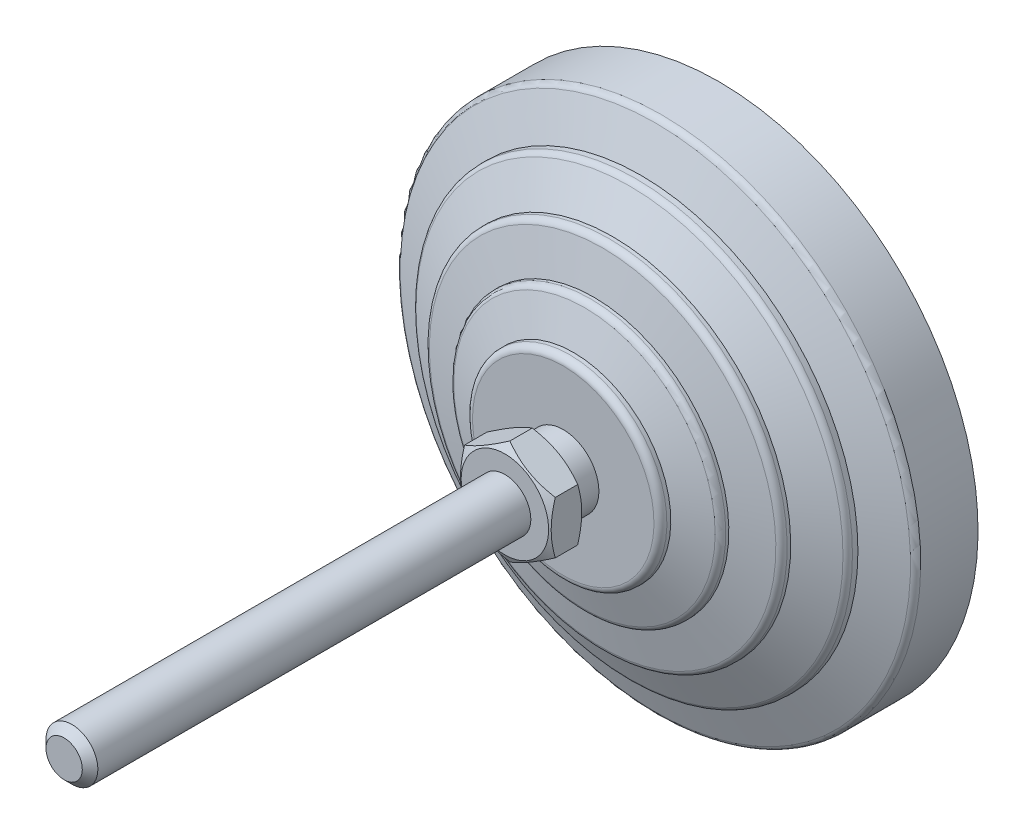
ISO-10303-21;
HEADER;
FILE_DESCRIPTION(('STEP AP214'),'2;1');
FILE_NAME('part.step','',(''),(''),'','','');
FILE_SCHEMA(('AUTOMOTIVE_DESIGN { 1 0 10303 214 1 1 1 1 }'));
ENDSEC;
DATA;
#1=APPLICATION_CONTEXT('core data for automotive mechanical design processes');
#2=APPLICATION_PROTOCOL_DEFINITION('international standard','automotive_design',2000,#1);
#3=PRODUCT_CONTEXT('',#1,'mechanical');
#4=PRODUCT('Part','Part','',(#3));
#5=PRODUCT_RELATED_PRODUCT_CATEGORY('part','',(#4));
#6=PRODUCT_DEFINITION_FORMATION('','',#4);
#7=PRODUCT_DEFINITION_CONTEXT('part definition',#1,'design');
#8=PRODUCT_DEFINITION('design','',#6,#7);
#9=PRODUCT_DEFINITION_SHAPE('','',#8);
#10=(LENGTH_UNIT() NAMED_UNIT(*) SI_UNIT(.MILLI.,.METRE.));
#11=(NAMED_UNIT(*) PLANE_ANGLE_UNIT() SI_UNIT($,.RADIAN.));
#12=(NAMED_UNIT(*) SI_UNIT($,.STERADIAN.) SOLID_ANGLE_UNIT());
#13=UNCERTAINTY_MEASURE_WITH_UNIT(LENGTH_MEASURE(1.E-05),#10,'distance_accuracy_value','');
#14=(GEOMETRIC_REPRESENTATION_CONTEXT(3) GLOBAL_UNCERTAINTY_ASSIGNED_CONTEXT((#13)) GLOBAL_UNIT_ASSIGNED_CONTEXT((#10,
#11,#12)) REPRESENTATION_CONTEXT('',''));
#15=CARTESIAN_POINT('',(0.,0.,0.));
#16=DIRECTION('',(0.,0.,1.));
#17=DIRECTION('',(1.,0.,0.));
#18=AXIS2_PLACEMENT_3D('',#15,#16,#17);
#19=CARTESIAN_POINT('',(0.,0.,0.));
#20=DIRECTION('',(0.,0.,-1.));
#21=DIRECTION('',(0.,1.,0.));
#22=AXIS2_PLACEMENT_3D('',#19,#20,#21);
#23=CYLINDRICAL_SURFACE('',#22,40.);
#24=CARTESIAN_POINT('',(0.,0.,2.99999999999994));
#25=DIRECTION('',(0.,0.,-1.));
#26=DIRECTION('',(0.,1.,0.));
#27=AXIS2_PLACEMENT_3D('',#24,#25,#26);
#28=CIRCLE('',#27,40.);
#29=CARTESIAN_POINT('',(0.,40.,2.99999999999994));
#30=VERTEX_POINT('',#29);
#31=EDGE_CURVE('E27',#30,#30,#28,.T.);
#32=ORIENTED_EDGE('',*,*,#31,.F.);
#33=EDGE_LOOP('',(#32));
#34=FACE_BOUND('',#33,.T.);
#35=CARTESIAN_POINT('',(0.,0.,11.8447046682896));
#36=DIRECTION('',(0.,0.,-1.));
#37=DIRECTION('',(0.,1.,0.));
#38=AXIS2_PLACEMENT_3D('',#35,#36,#37);
#39=CIRCLE('',#38,40.);
#40=CARTESIAN_POINT('',(0.,40.,11.8447046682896));
#41=VERTEX_POINT('',#40);
#42=EDGE_CURVE('E95',#41,#41,#39,.T.);
#43=ORIENTED_EDGE('',*,*,#42,.T.);
#44=EDGE_LOOP('',(#43));
#45=FACE_BOUND('',#44,.T.);
#46=ADVANCED_FACE('F14',(#34,#45),#23,.T.);
#47=CARTESIAN_POINT('',(-33.5,0.,2.99999999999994));
#48=DIRECTION('',(0.,0.,1.));
#49=DIRECTION('',(0.,-1.,0.));
#50=AXIS2_PLACEMENT_3D('',#47,#48,#49);
#51=PLANE('',#50);
#52=CARTESIAN_POINT('',(0.,0.,2.99999999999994));
#53=DIRECTION('',(0.,0.,-1.));
#54=DIRECTION('',(0.,1.,0.));
#55=AXIS2_PLACEMENT_3D('',#52,#53,#54);
#56=CIRCLE('',#55,33.5);
#57=CARTESIAN_POINT('',(0.,33.5,2.99999999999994));
#58=VERTEX_POINT('',#57);
#59=EDGE_CURVE('E155',#58,#58,#56,.T.);
#60=ORIENTED_EDGE('',*,*,#59,.F.);
#61=EDGE_LOOP('',(#60));
#62=FACE_BOUND('',#61,.T.);
#63=ORIENTED_EDGE('',*,*,#31,.T.);
#64=EDGE_LOOP('',(#63));
#65=FACE_BOUND('',#64,.T.);
#66=ADVANCED_FACE('F160',(#62,#65),#51,.F.);
#67=CARTESIAN_POINT('',(0.,0.,0.));
#68=DIRECTION('',(0.,0.,-1.));
#69=DIRECTION('',(0.,1.,0.));
#70=AXIS2_PLACEMENT_3D('',#67,#68,#69);
#71=CYLINDRICAL_SURFACE('',#70,33.5);
#72=CARTESIAN_POINT('',(0.,0.,0.));
#73=DIRECTION('',(0.,0.,-1.));
#74=DIRECTION('',(0.,1.,0.));
#75=AXIS2_PLACEMENT_3D('',#72,#73,#74);
#76=CIRCLE('',#75,33.5);
#77=CARTESIAN_POINT('',(0.,33.5,0.));
#78=VERTEX_POINT('',#77);
#79=EDGE_CURVE('E152',#78,#78,#76,.T.);
#80=ORIENTED_EDGE('',*,*,#79,.F.);
#81=EDGE_LOOP('',(#80));
#82=FACE_BOUND('',#81,.T.);
#83=ORIENTED_EDGE('',*,*,#59,.T.);
#84=EDGE_LOOP('',(#83));
#85=FACE_BOUND('',#84,.T.);
#86=ADVANCED_FACE('F266',(#82,#85),#71,.T.);
#87=CARTESIAN_POINT('',(0.,0.,0.));
#88=DIRECTION('',(0.,0.,1.));
#89=DIRECTION('',(0.,-1.,0.));
#90=AXIS2_PLACEMENT_3D('',#87,#88,#89);
#91=PLANE('',#90);
#92=ORIENTED_EDGE('',*,*,#79,.T.);
#93=EDGE_LOOP('',(#92));
#94=FACE_BOUND('',#93,.T.);
#95=ADVANCED_FACE('F258',(#94),#91,.F.);
#96=CARTESIAN_POINT('',(-5.49999999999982,0.,31.));
#97=DIRECTION('',(0.,0.,1.));
#98=DIRECTION('',(0.,-1.,0.));
#99=AXIS2_PLACEMENT_3D('',#96,#97,#98);
#100=PLANE('',#99);
#101=CARTESIAN_POINT('',(0.,0.,31.));
#102=DIRECTION('',(0.,0.,-1.));
#103=DIRECTION('',(-1.,0.,0.));
#104=AXIS2_PLACEMENT_3D('',#101,#102,#103);
#105=CIRCLE('',#104,6.75);
#106=CARTESIAN_POINT('',(-6.75,0.,31.));
#107=VERTEX_POINT('',#106);
#108=EDGE_CURVE('E598',#107,#107,#105,.T.);
#109=ORIENTED_EDGE('',*,*,#108,.T.);
#110=EDGE_LOOP('',(#109));
#111=FACE_BOUND('',#110,.T.);
#112=CARTESIAN_POINT('',(0.,0.,31.));
#113=DIRECTION('',(0.,0.,-1.));
#114=DIRECTION('',(0.,1.,0.));
#115=AXIS2_PLACEMENT_3D('',#112,#113,#114);
#116=CIRCLE('',#115,5.49999999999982);
#117=CARTESIAN_POINT('',(0.,5.49999999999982,31.));
#118=VERTEX_POINT('',#117);
#119=EDGE_CURVE('E140',#118,#118,#116,.T.);
#120=ORIENTED_EDGE('',*,*,#119,.F.);
#121=EDGE_LOOP('',(#120));
#122=FACE_BOUND('',#121,.T.);
#123=ADVANCED_FACE('F253',(#111,#122),#100,.F.);
#124=CARTESIAN_POINT('',(0.,0.,0.));
#125=DIRECTION('',(0.,0.,-1.));
#126=DIRECTION('',(0.,1.,0.));
#127=AXIS2_PLACEMENT_3D('',#124,#125,#126);
#128=CYLINDRICAL_SURFACE('',#127,5.49999999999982);
#129=CARTESIAN_POINT('',(0.,0.,27.));
#130=DIRECTION('',(0.,0.,-1.));
#131=DIRECTION('',(0.,1.,0.));
#132=AXIS2_PLACEMENT_3D('',#129,#130,#131);
#133=CIRCLE('',#132,5.49999999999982);
#134=CARTESIAN_POINT('',(0.,5.49999999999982,27.));
#135=VERTEX_POINT('',#134);
#136=EDGE_CURVE('E137',#135,#135,#133,.T.);
#137=ORIENTED_EDGE('',*,*,#136,.F.);
#138=EDGE_LOOP('',(#137));
#139=FACE_BOUND('',#138,.T.);
#140=ORIENTED_EDGE('',*,*,#119,.T.);
#141=EDGE_LOOP('',(#140));
#142=FACE_BOUND('',#141,.T.);
#143=ADVANCED_FACE('F247',(#139,#142),#128,.T.);
#144=CARTESIAN_POINT('',(-5.49999999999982,0.,27.));
#145=DIRECTION('',(0.,0.,-1.));
#146=DIRECTION('',(0.,1.,0.));
#147=AXIS2_PLACEMENT_3D('',#144,#145,#146);
#148=PLANE('',#147);
#149=CARTESIAN_POINT('',(0.,0.,27.));
#150=DIRECTION('',(0.,0.,-1.));
#151=DIRECTION('',(0.,1.,0.));
#152=AXIS2_PLACEMENT_3D('',#149,#150,#151);
#153=CIRCLE('',#152,14.);
#154=CARTESIAN_POINT('',(0.,14.,27.));
#155=VERTEX_POINT('',#154);
#156=EDGE_CURVE('E134',#155,#155,#153,.T.);
#157=ORIENTED_EDGE('',*,*,#156,.F.);
#158=EDGE_LOOP('',(#157));
#159=FACE_BOUND('',#158,.T.);
#160=ORIENTED_EDGE('',*,*,#136,.T.);
#161=EDGE_LOOP('',(#160));
#162=FACE_BOUND('',#161,.T.);
#163=ADVANCED_FACE('F241',(#159,#162),#148,.F.);
#164=CARTESIAN_POINT('',(0.,0.,26.));
#165=DIRECTION('',(0.,0.,-1.));
#166=DIRECTION('',(0.,1.,0.));
#167=AXIS2_PLACEMENT_3D('',#164,#165,#166);
#168=TOROIDAL_SURFACE('',#167,14.,1.);
#169=CARTESIAN_POINT('',(0.,0.,26.));
#170=DIRECTION('',(0.,0.,-1.));
#171=DIRECTION('',(0.,1.,0.));
#172=AXIS2_PLACEMENT_3D('',#169,#170,#171);
#173=CIRCLE('',#172,15.);
#174=CARTESIAN_POINT('',(0.,15.,26.));
#175=VERTEX_POINT('',#174);
#176=EDGE_CURVE('E131',#175,#175,#173,.T.);
#177=ORIENTED_EDGE('',*,*,#176,.F.);
#178=EDGE_LOOP('',(#177));
#179=FACE_BOUND('',#178,.T.);
#180=ORIENTED_EDGE('',*,*,#156,.T.);
#181=EDGE_LOOP('',(#180));
#182=FACE_BOUND('',#181,.T.);
#183=ADVANCED_FACE('F235',(#179,#182),#168,.T.);
#184=CARTESIAN_POINT('',(0.,0.,0.));
#185=DIRECTION('',(0.,0.,-1.));
#186=DIRECTION('',(0.,1.,0.));
#187=AXIS2_PLACEMENT_3D('',#184,#185,#186);
#188=CYLINDRICAL_SURFACE('',#187,15.);
#189=CARTESIAN_POINT('',(0.,0.,25.4025287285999));
#190=DIRECTION('',(0.,0.,-1.));
#191=DIRECTION('',(0.,1.,0.));
#192=AXIS2_PLACEMENT_3D('',#189,#190,#191);
#193=CIRCLE('',#192,15.);
#194=CARTESIAN_POINT('',(0.,15.,25.4025287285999));
#195=VERTEX_POINT('',#194);
#196=EDGE_CURVE('E128',#195,#195,#193,.T.);
#197=ORIENTED_EDGE('',*,*,#196,.F.);
#198=EDGE_LOOP('',(#197));
#199=FACE_BOUND('',#198,.T.);
#200=ORIENTED_EDGE('',*,*,#176,.T.);
#201=EDGE_LOOP('',(#200));
#202=FACE_BOUND('',#201,.T.);
#203=ADVANCED_FACE('F229',(#199,#202),#188,.T.);
#204=CARTESIAN_POINT('',(0.,0.,25.4025287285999));
#205=DIRECTION('',(0.,0.,-1.));
#206=DIRECTION('',(0.,1.,0.));
#207=AXIS2_PLACEMENT_3D('',#204,#205,#206);
#208=CONICAL_SURFACE('',#207,15.,1.25589726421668);
#209=CARTESIAN_POINT('',(0.,0.,23.7216684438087));
#210=DIRECTION('',(0.,0.,-1.));
#211=DIRECTION('',(0.,1.,0.));
#212=AXIS2_PLACEMENT_3D('',#209,#210,#211);
#213=CIRCLE('',#212,20.16016354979);
#214=CARTESIAN_POINT('',(0.,20.16016354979,23.7216684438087));
#215=VERTEX_POINT('',#214);
#216=EDGE_CURVE('E125',#215,#215,#213,.T.);
#217=ORIENTED_EDGE('',*,*,#216,.F.);
#218=EDGE_LOOP('',(#217));
#219=FACE_BOUND('',#218,.T.);
#220=ORIENTED_EDGE('',*,*,#196,.T.);
#221=EDGE_LOOP('',(#220));
#222=FACE_BOUND('',#221,.T.);
#223=ADVANCED_FACE('F223',(#219,#222),#208,.T.);
#224=CARTESIAN_POINT('',(0.,0.,22.7708407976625));
#225=DIRECTION('',(0.,0.,-1.));
#226=DIRECTION('',(0.,1.,0.));
#227=AXIS2_PLACEMENT_3D('',#224,#225,#226);
#228=TOROIDAL_SURFACE('',#227,19.8504430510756,1.);
#229=CARTESIAN_POINT('',(0.,0.,22.7708407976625));
#230=DIRECTION('',(0.,0.,-1.));
#231=DIRECTION('',(0.,1.,0.));
#232=AXIS2_PLACEMENT_3D('',#229,#230,#231);
#233=CIRCLE('',#232,20.8504430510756);
#234=CARTESIAN_POINT('',(0.,20.8504430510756,22.7708407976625));
#235=VERTEX_POINT('',#234);
#236=EDGE_CURVE('E122',#235,#235,#233,.T.);
#237=ORIENTED_EDGE('',*,*,#236,.F.);
#238=EDGE_LOOP('',(#237));
#239=FACE_BOUND('',#238,.T.);
#240=ORIENTED_EDGE('',*,*,#216,.T.);
#241=EDGE_LOOP('',(#240));
#242=FACE_BOUND('',#241,.T.);
#243=ADVANCED_FACE('F217',(#239,#242),#228,.T.);
#244=CARTESIAN_POINT('',(0.,0.,0.));
#245=DIRECTION('',(0.,0.,-1.));
#246=DIRECTION('',(0.,1.,0.));
#247=AXIS2_PLACEMENT_3D('',#244,#245,#246);
#248=CYLINDRICAL_SURFACE('',#247,20.8504430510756);
#249=CARTESIAN_POINT('',(0.,0.,22.2987385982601));
#250=DIRECTION('',(0.,0.,-1.));
#251=DIRECTION('',(0.,1.,0.));
#252=AXIS2_PLACEMENT_3D('',#249,#250,#251);
#253=CIRCLE('',#252,20.8504430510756);
#254=CARTESIAN_POINT('',(0.,20.8504430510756,22.2987385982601));
#255=VERTEX_POINT('',#254);
#256=EDGE_CURVE('E119',#255,#255,#253,.T.);
#257=ORIENTED_EDGE('',*,*,#256,.F.);
#258=EDGE_LOOP('',(#257));
#259=FACE_BOUND('',#258,.T.);
#260=ORIENTED_EDGE('',*,*,#236,.T.);
#261=EDGE_LOOP('',(#260));
#262=FACE_BOUND('',#261,.T.);
#263=ADVANCED_FACE('F211',(#259,#262),#248,.T.);
#264=CARTESIAN_POINT('',(0.,0.,22.2987385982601));
#265=DIRECTION('',(0.,0.,-1.));
#266=DIRECTION('',(0.,1.,0.));
#267=AXIS2_PLACEMENT_3D('',#264,#265,#266);
#268=CONICAL_SURFACE('',#267,20.8504430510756,1.34067144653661);
#269=CARTESIAN_POINT('',(0.,0.,20.9217501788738));
#270=DIRECTION('',(0.,0.,-1.));
#271=DIRECTION('',(0.,1.,0.));
#272=AXIS2_PLACEMENT_3D('',#269,#270,#271);
#273=CIRCLE('',#272,26.728099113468);
#274=CARTESIAN_POINT('',(0.,26.728099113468,20.9217501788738));
#275=VERTEX_POINT('',#274);
#276=EDGE_CURVE('E116',#275,#275,#273,.T.);
#277=ORIENTED_EDGE('',*,*,#276,.F.);
#278=EDGE_LOOP('',(#277));
#279=FACE_BOUND('',#278,.T.);
#280=ORIENTED_EDGE('',*,*,#256,.T.);
#281=EDGE_LOOP('',(#280));
#282=FACE_BOUND('',#281,.T.);
#283=ADVANCED_FACE('F205',(#279,#282),#268,.T.);
#284=CARTESIAN_POINT('',(0.,0.,19.9481122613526));
#285=DIRECTION('',(0.,0.,-1.));
#286=DIRECTION('',(0.,1.,0.));
#287=AXIS2_PLACEMENT_3D('',#284,#285,#286);
#288=TOROIDAL_SURFACE('',#287,26.5,1.);
#289=CARTESIAN_POINT('',(0.,0.,19.9481122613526));
#290=DIRECTION('',(0.,0.,-1.));
#291=DIRECTION('',(0.,1.,0.));
#292=AXIS2_PLACEMENT_3D('',#289,#290,#291);
#293=CIRCLE('',#292,27.5);
#294=CARTESIAN_POINT('',(0.,27.5,19.9481122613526));
#295=VERTEX_POINT('',#294);
#296=EDGE_CURVE('E113',#295,#295,#293,.T.);
#297=ORIENTED_EDGE('',*,*,#296,.F.);
#298=EDGE_LOOP('',(#297));
#299=FACE_BOUND('',#298,.T.);
#300=ORIENTED_EDGE('',*,*,#276,.T.);
#301=EDGE_LOOP('',(#300));
#302=FACE_BOUND('',#301,.T.);
#303=ADVANCED_FACE('F199',(#299,#302),#288,.T.);
#304=CARTESIAN_POINT('',(0.,0.,0.));
#305=DIRECTION('',(0.,0.,-1.));
#306=DIRECTION('',(0.,1.,0.));
#307=AXIS2_PLACEMENT_3D('',#304,#305,#306);
#308=CYLINDRICAL_SURFACE('',#307,27.5);
#309=CARTESIAN_POINT('',(0.,0.,19.4025287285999));
#310=DIRECTION('',(0.,0.,-1.));
#311=DIRECTION('',(0.,1.,0.));
#312=AXIS2_PLACEMENT_3D('',#309,#310,#311);
#313=CIRCLE('',#312,27.5);
#314=CARTESIAN_POINT('',(0.,27.5,19.4025287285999));
#315=VERTEX_POINT('',#314);
#316=EDGE_CURVE('E110',#315,#315,#313,.T.);
#317=ORIENTED_EDGE('',*,*,#316,.F.);
#318=EDGE_LOOP('',(#317));
#319=FACE_BOUND('',#318,.T.);
#320=ORIENTED_EDGE('',*,*,#296,.T.);
#321=EDGE_LOOP('',(#320));
#322=FACE_BOUND('',#321,.T.);
#323=ADVANCED_FACE('F193',(#319,#322),#308,.T.);
#324=CARTESIAN_POINT('',(0.,0.,19.4025287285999));
#325=DIRECTION('',(0.,0.,-1.));
#326=DIRECTION('',(0.,1.,0.));
#327=AXIS2_PLACEMENT_3D('',#324,#325,#326);
#328=CONICAL_SURFACE('',#327,27.5,1.12022914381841);
#329=CARTESIAN_POINT('',(0.,0.,16.7730910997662));
#330=DIRECTION('',(0.,0.,-1.));
#331=DIRECTION('',(0.,1.,0.));
#332=AXIS2_PLACEMENT_3D('',#329,#330,#331);
#333=CIRCLE('',#332,32.935476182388);
#334=CARTESIAN_POINT('',(0.,32.935476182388,16.7730910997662));
#335=VERTEX_POINT('',#334);
#336=EDGE_CURVE('E107',#335,#335,#333,.T.);
#337=ORIENTED_EDGE('',*,*,#336,.F.);
#338=EDGE_LOOP('',(#337));
#339=FACE_BOUND('',#338,.T.);
#340=ORIENTED_EDGE('',*,*,#316,.T.);
#341=EDGE_LOOP('',(#340));
#342=FACE_BOUND('',#341,.T.);
#343=ADVANCED_FACE('F187',(#339,#342),#328,.T.);
#344=CARTESIAN_POINT('',(0.,0.,15.8728908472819));
#345=DIRECTION('',(0.,0.,-1.));
#346=DIRECTION('',(0.,1.,0.));
#347=AXIS2_PLACEMENT_3D('',#344,#345,#346);
#348=TOROIDAL_SURFACE('',#347,32.5,1.);
#349=CARTESIAN_POINT('',(0.,0.,15.8728908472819));
#350=DIRECTION('',(0.,0.,-1.));
#351=DIRECTION('',(0.,1.,0.));
#352=AXIS2_PLACEMENT_3D('',#349,#350,#351);
#353=CIRCLE('',#352,33.5);
#354=CARTESIAN_POINT('',(0.,33.5,15.8728908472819));
#355=VERTEX_POINT('',#354);
#356=EDGE_CURVE('E104',#355,#355,#353,.T.);
#357=ORIENTED_EDGE('',*,*,#356,.F.);
#358=EDGE_LOOP('',(#357));
#359=FACE_BOUND('',#358,.T.);
#360=ORIENTED_EDGE('',*,*,#336,.T.);
#361=EDGE_LOOP('',(#360));
#362=FACE_BOUND('',#361,.T.);
#363=ADVANCED_FACE('F181',(#359,#362),#348,.T.);
#364=CARTESIAN_POINT('',(0.,0.,0.));
#365=DIRECTION('',(0.,0.,-1.));
#366=DIRECTION('',(0.,1.,0.));
#367=AXIS2_PLACEMENT_3D('',#364,#365,#366);
#368=CYLINDRICAL_SURFACE('',#367,33.5);
#369=CARTESIAN_POINT('',(0.,0.,15.0315037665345));
#370=DIRECTION('',(0.,0.,-1.));
#371=DIRECTION('',(0.,1.,0.));
#372=AXIS2_PLACEMENT_3D('',#369,#370,#371);
#373=CIRCLE('',#372,33.5);
#374=CARTESIAN_POINT('',(0.,33.5,15.0315037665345));
#375=VERTEX_POINT('',#374);
#376=EDGE_CURVE('E101',#375,#375,#373,.T.);
#377=ORIENTED_EDGE('',*,*,#376,.F.);
#378=EDGE_LOOP('',(#377));
#379=FACE_BOUND('',#378,.T.);
#380=ORIENTED_EDGE('',*,*,#356,.T.);
#381=EDGE_LOOP('',(#380));
#382=FACE_BOUND('',#381,.T.);
#383=ADVANCED_FACE('F175',(#379,#382),#368,.T.);
#384=CARTESIAN_POINT('',(0.,0.,15.0315037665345));
#385=DIRECTION('',(0.,0.,-1.));
#386=DIRECTION('',(0.,1.,0.));
#387=AXIS2_PLACEMENT_3D('',#384,#385,#386);
#388=CONICAL_SURFACE('',#387,33.5,1.20362249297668);
#389=CARTESIAN_POINT('',(0.,0.,12.7780502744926));
#390=DIRECTION('',(0.,0.,-1.));
#391=DIRECTION('',(0.,1.,0.));
#392=AXIS2_PLACEMENT_3D('',#389,#390,#391);
#393=CIRCLE('',#392,39.358979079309);
#394=CARTESIAN_POINT('',(0.,39.358979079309,12.7780502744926));
#395=VERTEX_POINT('',#394);
#396=EDGE_CURVE('E98',#395,#395,#393,.T.);
#397=ORIENTED_EDGE('',*,*,#396,.F.);
#398=EDGE_LOOP('',(#397));
#399=FACE_BOUND('',#398,.T.);
#400=ORIENTED_EDGE('',*,*,#376,.T.);
#401=EDGE_LOOP('',(#400));
#402=FACE_BOUND('',#401,.T.);
#403=ADVANCED_FACE('F169',(#399,#402),#388,.T.);
#404=CARTESIAN_POINT('',(0.,0.,11.8447046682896));
#405=DIRECTION('',(0.,0.,-1.));
#406=DIRECTION('',(0.,1.,0.));
#407=AXIS2_PLACEMENT_3D('',#404,#405,#406);
#408=TOROIDAL_SURFACE('',#407,39.,1.);
#409=ORIENTED_EDGE('',*,*,#42,.F.);
#410=EDGE_LOOP('',(#409));
#411=FACE_BOUND('',#410,.T.);
#412=ORIENTED_EDGE('',*,*,#396,.T.);
#413=EDGE_LOOP('',(#412));
#414=FACE_BOUND('',#413,.T.);
#415=ADVANCED_FACE('F166',(#411,#414),#408,.T.);
#416=CARTESIAN_POINT('',(0.,0.,32.4889303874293));
#417=DIRECTION('',(0.,0.,1.));
#418=DIRECTION('',(1.,0.,0.));
#419=AXIS2_PLACEMENT_3D('',#416,#417,#418);
#420=CONICAL_SURFACE('',#419,9.32890307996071,1.0471975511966);
#421=CARTESIAN_POINT('',(0.25673339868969,-8.23112886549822,31.8574411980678));
#422=CARTESIAN_POINT('',(-0.0699008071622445,-8.04254651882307,31.742723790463));
#423=CARTESIAN_POINT('',(-0.399589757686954,-7.85220051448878,31.637730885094));
#424=CARTESIAN_POINT('',(-1.0653462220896,-7.46782584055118,31.4534075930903));
#425=CARTESIAN_POINT('',(-1.40143059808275,-7.27378743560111,31.374159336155));
#426=CARTESIAN_POINT('',(-1.9041382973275,-6.98354901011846,31.2807011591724));
#427=CARTESIAN_POINT('',(-2.06901415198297,-6.88835789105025,31.2540040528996));
#428=CARTESIAN_POINT('',(-2.39962877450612,-6.69747744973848,31.2089599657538));
#429=CARTESIAN_POINT('',(-2.56536755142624,-6.60178812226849,31.1906130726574));
#430=CARTESIAN_POINT('',(-2.89713823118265,-6.4102402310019,31.1627929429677));
#431=CARTESIAN_POINT('',(-3.06316922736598,-6.31438219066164,31.1533054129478));
#432=CARTESIAN_POINT('',(-3.39543513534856,-6.12254837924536,31.1434241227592));
#433=CARTESIAN_POINT('',(-3.56167004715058,-6.02657260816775,31.1430303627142));
#434=CARTESIAN_POINT('',(-3.90435707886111,-5.82872215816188,31.1516105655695));
#435=CARTESIAN_POINT('',(-4.08079827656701,-5.72685378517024,31.1611716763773));
#436=CARTESIAN_POINT('',(-4.4330613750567,-5.52347459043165,31.1902671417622));
#437=CARTESIAN_POINT('',(-4.60888325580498,-5.4219637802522,31.2098018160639));
#438=CARTESIAN_POINT('',(-4.95987646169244,-5.21931775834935,31.2582943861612));
#439=CARTESIAN_POINT('',(-5.13504594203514,-5.11818361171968,31.2872699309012));
#440=CARTESIAN_POINT('',(-5.48415498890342,-4.91662540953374,31.3538402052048));
#441=CARTESIAN_POINT('',(-5.65809446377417,-4.81620140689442,31.3914355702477));
#442=CARTESIAN_POINT('',(-6.01011071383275,-4.61296473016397,31.4756703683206));
#443=CARTESIAN_POINT('',(-6.18814224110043,-4.51017817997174,31.5225602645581));
#444=CARTESIAN_POINT('',(-6.54267228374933,-4.30549016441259,31.6235624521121));
#445=CARTESIAN_POINT('',(-6.71917063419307,-4.20358879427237,31.677675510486));
#446=CARTESIAN_POINT('',(-7.06990087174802,-4.00109459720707,31.7919201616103));
#447=CARTESIAN_POINT('',(-7.2441391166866,-3.90049809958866,31.8520259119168));
#448=CARTESIAN_POINT('',(-7.59109714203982,-3.70018179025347,31.9775799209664));
#449=CARTESIAN_POINT('',(-7.76381747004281,-3.60046166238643,32.0430261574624));
#450=CARTESIAN_POINT('',(-7.93584837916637,-3.50113957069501,32.1107351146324));
#451=B_SPLINE_CURVE_WITH_KNOTS('',3,(#421,#422,#423,#424,#425,#426,#427,#428,#429,#430,#431,
#432,#433,#434,#435,#436,#437,#438,#439,#440,#441,#442,#443,#444,#445,#446,#447,#448,#449,#450),
.UNSPECIFIED.,.F.,.F.,(4,2,2,2,2,2,2,2,2,2,2,2,2,2,4),(0.,1.18341935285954,2.37057775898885,
2.94714380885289,3.52371591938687,4.09935619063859,4.67499646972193,5.28662203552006,
5.89826720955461,6.51106242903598,7.1239028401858,7.75631267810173,8.38878972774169,
9.01864849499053,9.64826985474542),.UNSPECIFIED.);
#452=CARTESIAN_POINT('',(0.,-8.08290376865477,31.7695523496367));
#453=VERTEX_POINT('',#452);
#454=CARTESIAN_POINT('',(-7.,-4.04145188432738,31.7695523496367));
#455=VERTEX_POINT('',#454);
#456=EDGE_CURVE('E72',#453,#455,#451,.T.);
#457=ORIENTED_EDGE('',*,*,#456,.T.);
#458=CARTESIAN_POINT('',(-7.,-10.7984910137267,34.5327221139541));
#459=CARTESIAN_POINT('',(-7.,-10.4932296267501,34.3848744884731));
#460=CARTESIAN_POINT('',(-7.,-10.1872612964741,34.2384611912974));
#461=CARTESIAN_POINT('',(-7.,-9.57353455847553,33.949311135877));
#462=CARTESIAN_POINT('',(-7.,-9.26577587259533,33.8065749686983));
#463=CARTESIAN_POINT('',(-7.,-8.64647888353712,33.524856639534));
#464=CARTESIAN_POINT('',(-7.,-8.33492908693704,33.3858996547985));
#465=CARTESIAN_POINT('',(-7.,-7.70933139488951,33.1137495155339));
#466=CARTESIAN_POINT('',(-7.,-7.3952836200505,32.9805560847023));
#467=CARTESIAN_POINT('',(-7.,-6.75428038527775,32.7173881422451));
#468=CARTESIAN_POINT('',(-7.,-6.42722909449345,32.5876457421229));
#469=CARTESIAN_POINT('',(-7.,-5.76927991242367,32.3381199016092));
#470=CARTESIAN_POINT('',(-7.,-5.43838159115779,32.2183375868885));
#471=CARTESIAN_POINT('',(-7.,-4.77284601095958,31.9919189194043));
#472=CARTESIAN_POINT('',(-7.,-4.4382180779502,31.8852554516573));
#473=CARTESIAN_POINT('',(-7.,-3.7641749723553,31.6885333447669));
#474=CARTESIAN_POINT('',(-7.,-3.42476136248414,31.5984694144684));
#475=CARTESIAN_POINT('',(-7.,-2.74276834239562,31.4397877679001));
#476=CARTESIAN_POINT('',(-7.,-2.40021620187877,31.3710560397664));
#477=CARTESIAN_POINT('',(-7.,-1.88331502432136,31.2869621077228));
#478=CARTESIAN_POINT('',(-7.,-1.71048933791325,31.2620969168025));
#479=CARTESIAN_POINT('',(-7.,-1.36399858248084,31.2191900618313));
#480=CARTESIAN_POINT('',(-7.,-1.19033359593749,31.2011477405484));
#481=CARTESIAN_POINT('',(-7.,-0.844640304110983,31.1724694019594));
#482=CARTESIAN_POINT('',(-7.,-0.672619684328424,31.1617410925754));
#483=CARTESIAN_POINT('',(-7.,-0.328279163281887,31.1475644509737));
#484=CARTESIAN_POINT('',(-7.,-0.155959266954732,31.1441159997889));
#485=CARTESIAN_POINT('',(-7.,0.188672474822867,31.1445812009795));
#486=CARTESIAN_POINT('',(-7.,0.360984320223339,31.1484948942));
#487=CARTESIAN_POINT('',(-7.,0.70529166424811,31.1635897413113));
#488=CARTESIAN_POINT('',(-7.,0.877287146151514,31.1747712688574));
#489=CARTESIAN_POINT('',(-7.,1.29239891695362,31.210293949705));
#490=CARTESIAN_POINT('',(-7.,1.53521800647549,31.2381807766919));
#491=CARTESIAN_POINT('',(-7.,2.01900465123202,31.306905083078));
#492=CARTESIAN_POINT('',(-7.,2.25997194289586,31.347744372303));
#493=CARTESIAN_POINT('',(-7.,2.97984833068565,31.4875211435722));
#494=CARTESIAN_POINT('',(-7.,3.45545305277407,31.6036905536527));
#495=CARTESIAN_POINT('',(-7.,4.16653525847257,31.8045165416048));
#496=CARTESIAN_POINT('',(-7.,4.40571658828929,31.8768075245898));
#497=CARTESIAN_POINT('',(-7.,4.8817551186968,32.0287427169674));
#498=CARTESIAN_POINT('',(-7.,5.11861230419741,32.1083869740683));
#499=CARTESIAN_POINT('',(-7.,5.59008008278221,32.2737637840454));
#500=CARTESIAN_POINT('',(-7.,5.82469142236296,32.3594942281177));
#501=CARTESIAN_POINT('',(-7.,6.29198076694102,32.5360502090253));
#502=CARTESIAN_POINT('',(-7.,6.52465879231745,32.6268756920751));
#503=CARTESIAN_POINT('',(-7.,7.06434796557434,32.8432654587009));
#504=CARTESIAN_POINT('',(-7.,7.37070718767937,32.9704524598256));
#505=CARTESIAN_POINT('',(-7.,7.98090130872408,33.2307608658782));
#506=CARTESIAN_POINT('',(-7.,8.28473606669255,33.3638825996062));
#507=CARTESIAN_POINT('',(-7.,8.89033339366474,33.6348948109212));
#508=CARTESIAN_POINT('',(-7.,9.19209556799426,33.7727861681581));
#509=CARTESIAN_POINT('',(-7.,9.79384057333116,34.0524048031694));
#510=CARTESIAN_POINT('',(-7.,10.0938233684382,34.1941321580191));
#511=CARTESIAN_POINT('',(-7.,10.6925893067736,34.4808588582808));
#512=CARTESIAN_POINT('',(-7.,10.9913709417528,34.6258613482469));
#513=CARTESIAN_POINT('',(-7.,11.5876652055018,34.9184548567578));
#514=CARTESIAN_POINT('',(-7.,11.8851778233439,35.0660458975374));
#515=CARTESIAN_POINT('',(-7.,12.7760362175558,35.5119904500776));
#516=CARTESIAN_POINT('',(-7.,13.367776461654,35.8135510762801));
#517=CARTESIAN_POINT('',(-7.,14.5002021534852,36.3979944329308));
#518=CARTESIAN_POINT('',(-7.,15.0411319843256,36.680405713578));
#519=CARTESIAN_POINT('',(-7.,16.1209744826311,37.2490982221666));
#520=CARTESIAN_POINT('',(-7.,16.6598870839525,37.5353795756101));
#521=CARTESIAN_POINT('',(-7.,17.7348629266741,38.1102209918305));
#522=CARTESIAN_POINT('',(-7.,18.2709298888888,38.3987741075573));
#523=CARTESIAN_POINT('',(-7.,19.3417684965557,38.9782084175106));
#524=CARTESIAN_POINT('',(-7.,19.8765402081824,39.2690894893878));
#525=CARTESIAN_POINT('',(-7.,20.4108324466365,39.5608427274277));
#526=B_SPLINE_CURVE_WITH_KNOTS('',3,(#458,#459,#460,#461,#462,#463,#464,#465,#466,#467,#468,
#469,#470,#471,#472,#473,#474,#475,#476,#477,#478,#479,#480,#481,#482,#483,#484,#485,#486,#487,
#488,#489,#490,#491,#492,#493,#494,#495,#496,#497,#498,#499,#500,#501,#502,#503,#504,#505,#506,
#507,#508,#509,#510,#511,#512,#513,#514,#515,#516,#517,#518,#519,#520,#521,#522,#523,#524,#525),
.UNSPECIFIED.,.F.,.F.,(4,2,2,2,2,2,2,2,2,2,2,2,2,2,2,2,2,2,2,2,2,2,2,2,2,2,2,2,2,2,2,2,2,4),(0.,
1.01755430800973,2.0352711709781,3.05862604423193,4.08193180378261,5.13734409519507,
6.19287550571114,7.24618723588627,8.29916263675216,9.34640934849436,9.87011159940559,
10.3937633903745,10.910678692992,11.4275855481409,11.9444952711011,12.4614315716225,
13.194261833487,13.9271945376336,15.3938967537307,16.1434383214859,16.8929847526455,
17.6422727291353,18.391552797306,19.3866039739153,20.3817103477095,21.37700123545,
22.3723121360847,23.3686231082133,24.3649426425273,26.3573354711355,28.1879609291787,
30.0186458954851,31.8450231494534,33.6713050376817),.UNSPECIFIED.);
#527=CARTESIAN_POINT('',(-7.,4.04145188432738,31.7695523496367));
#528=VERTEX_POINT('',#527);
#529=EDGE_CURVE('E80',#455,#528,#526,.T.);
#530=ORIENTED_EDGE('',*,*,#529,.T.);
#531=CARTESIAN_POINT('',(-12.6807765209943,0.761654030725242,34.437329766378));
#532=CARTESIAN_POINT('',(-12.4122294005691,0.916699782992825,34.287976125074));
#533=CARTESIAN_POINT('',(-12.1430283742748,1.07212306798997,34.1401601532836));
#534=CARTESIAN_POINT('',(-11.6029576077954,1.38393307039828,33.8484999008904));
#535=CARTESIAN_POINT('',(-11.3320875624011,1.54031996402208,33.7046563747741));
#536=CARTESIAN_POINT('',(-10.7867017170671,1.85519862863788,33.4210012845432));
#537=CARTESIAN_POINT('',(-10.5121736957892,2.01369745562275,33.2812209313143));
#538=CARTESIAN_POINT('',(-9.960780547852,2.33204443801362,33.007973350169));
#539=CARTESIAN_POINT('',(-9.68391555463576,2.4918925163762,32.8745057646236));
#540=CARTESIAN_POINT('',(-9.1248352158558,2.81467770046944,32.6144210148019));
#541=CARTESIAN_POINT('',(-8.84259410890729,2.97762967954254,32.4878772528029));
#542=CARTESIAN_POINT('',(-8.27467934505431,3.30551542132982,32.2453021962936));
#543=CARTESIAN_POINT('',(-7.98900528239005,3.47044941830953,32.1292721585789));
#544=CARTESIAN_POINT('',(-7.41443133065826,3.80217984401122,31.9110809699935));
#545=CARTESIAN_POINT('',(-7.12554089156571,3.96897081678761,31.808887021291));
#546=CARTESIAN_POINT('',(-6.54361723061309,4.30494459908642,31.6219147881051));
#547=CARTESIAN_POINT('',(-6.25058548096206,4.47412655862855,31.5371304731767));
#548=CARTESIAN_POINT('',(-5.66463049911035,4.81242782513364,31.390499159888));
#549=CARTESIAN_POINT('',(-5.37176868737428,4.98151167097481,31.3283340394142));
#550=CARTESIAN_POINT('',(-4.9300766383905,5.23652269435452,31.2541776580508));
#551=CARTESIAN_POINT('',(-4.78242653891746,5.32176851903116,31.2326391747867));
#552=CARTESIAN_POINT('',(-4.48650641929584,5.49261807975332,31.1963528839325));
#553=CARTESIAN_POINT('',(-4.33823645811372,5.57822178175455,31.1816044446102));
#554=CARTESIAN_POINT('',(-4.04211761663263,5.74918607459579,31.1592863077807));
#555=CARTESIAN_POINT('',(-3.8942709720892,5.83454537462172,31.1516771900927));
#556=CARTESIAN_POINT('',(-3.59843219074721,6.00534797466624,31.1436692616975));
#557=CARTESIAN_POINT('',(-3.45044005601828,6.09079127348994,31.1432703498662));
#558=CARTESIAN_POINT('',(-3.15461041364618,6.26158859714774,31.1496921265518));
#559=CARTESIAN_POINT('',(-3.00677287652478,6.34694263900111,31.1565110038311));
#560=CARTESIAN_POINT('',(-2.71146648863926,6.51743786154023,31.177206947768));
#561=CARTESIAN_POINT('',(-2.56399765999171,6.60257902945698,31.1910844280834));
#562=CARTESIAN_POINT('',(-2.19996547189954,6.81275311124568,31.2337753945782));
#563=CARTESIAN_POINT('',(-1.98374431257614,6.93758845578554,31.2665496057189));
#564=CARTESIAN_POINT('',(-1.55313509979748,7.18620080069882,31.3453889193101));
#565=CARTESIAN_POINT('',(-1.33874735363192,7.30997762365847,31.3914562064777));
#566=CARTESIAN_POINT('',(-0.697890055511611,7.67997675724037,31.5472676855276));
#567=CARTESIAN_POINT('',(-0.274581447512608,7.92437409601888,31.674508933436));
#568=CARTESIAN_POINT('',(0.358252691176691,8.28974105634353,31.8918778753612));
#569=CARTESIAN_POINT('',(0.571123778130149,8.4126422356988,31.9697400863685));
#570=CARTESIAN_POINT('',(0.994810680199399,8.6572579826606,32.1327250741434));
#571=CARTESIAN_POINT('',(1.20562631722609,8.77897244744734,32.2178484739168));
#572=CARTESIAN_POINT('',(1.62414462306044,9.02060410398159,32.3935708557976));
#573=CARTESIAN_POINT('',(1.83185823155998,9.14052761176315,32.4841354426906));
#574=CARTESIAN_POINT('',(2.24555099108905,9.37937323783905,32.6701821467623));
#575=CARTESIAN_POINT('',(2.45153069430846,9.49829567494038,32.7656626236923));
#576=CARTESIAN_POINT('',(2.65678559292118,9.61679964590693,32.8631329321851));
#577=B_SPLINE_CURVE_WITH_KNOTS('',3,(#531,#532,#533,#534,#535,#536,#537,#538,#539,#540,#541,
#542,#543,#544,#545,#546,#547,#548,#549,#550,#551,#552,#553,#554,#555,#556,#557,#558,#559,#560,
#561,#562,#563,#564,#565,#566,#567,#568,#569,#570,#571,#572,#573,#574,#575,#576),.UNSPECIFIED.,
.F.,.F.,(4,2,2,2,2,2,2,2,2,2,2,2,2,2,2,2,2,2,2,2,2,2,4),(0.,1.03256994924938,2.06533468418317,
3.10462356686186,4.14385350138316,5.19254165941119,6.24135501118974,7.28763696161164,
8.33355588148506,9.36413740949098,9.87956343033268,10.3949414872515,10.9074568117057,
11.4199649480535,11.9323445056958,12.4447540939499,13.1997577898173,13.9548856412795,
15.4681092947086,16.2415753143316,17.0151077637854,17.7841808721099,18.5529990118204),.UNSPECIFIED.);
#578=CARTESIAN_POINT('',(0.,8.08290376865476,31.7695523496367));
#579=VERTEX_POINT('',#578);
#580=EDGE_CURVE('E553',#528,#579,#577,.T.);
#581=ORIENTED_EDGE('',*,*,#580,.T.);
#582=CARTESIAN_POINT('',(-0.942418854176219,8.62700954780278,32.1133230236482));
#583=CARTESIAN_POINT('',(-0.770294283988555,8.52763338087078,32.0455119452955));
#584=CARTESIAN_POINT('',(-0.597480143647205,8.42785909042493,31.9799619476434));
#585=CARTESIAN_POINT('',(-0.250333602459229,8.2274339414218,31.8541975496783));
#586=CARTESIAN_POINT('',(-0.0760006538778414,8.12678276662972,31.7939851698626));
#587=CARTESIAN_POINT('',(0.274922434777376,7.92417722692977,31.6795238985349));
#588=CARTESIAN_POINT('',(0.451518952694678,7.82221917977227,31.6253008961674));
#589=CARTESIAN_POINT('',(0.806247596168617,7.61741650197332,31.5240776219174));
#590=CARTESIAN_POINT('',(0.984379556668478,7.51457196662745,31.477076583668));
#591=CARTESIAN_POINT('',(1.33659339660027,7.31122121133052,31.3926242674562));
#592=CARTESIAN_POINT('',(1.51062990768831,7.21074118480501,31.3549223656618));
#593=CARTESIAN_POINT('',(1.85993658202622,7.00906888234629,31.2881415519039));
#594=CARTESIAN_POINT('',(2.03520665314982,6.90787665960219,31.2590620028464));
#595=CARTESIAN_POINT('',(2.38640452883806,6.70511247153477,31.2103671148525));
#596=CARTESIAN_POINT('',(2.56233047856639,6.60354157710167,31.1907340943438));
#597=CARTESIAN_POINT('',(2.91480587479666,6.4000398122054,31.1614506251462));
#598=CARTESIAN_POINT('',(3.09135530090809,6.29810895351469,31.1517998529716));
#599=CARTESIAN_POINT('',(3.43407151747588,6.10024165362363,31.1430617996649));
#600=CARTESIAN_POINT('',(3.60022698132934,6.00431175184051,31.1433765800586));
#601=CARTESIAN_POINT('',(3.93233746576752,5.81256767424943,31.1530924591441));
#602=CARTESIAN_POINT('',(4.09829248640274,5.71675349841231,31.1624935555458));
#603=CARTESIAN_POINT('',(4.42991421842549,5.52529160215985,31.1901358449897));
#604=CARTESIAN_POINT('',(4.59558003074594,5.42964440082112,31.2083912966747));
#605=CARTESIAN_POINT('',(4.92605212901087,5.23884624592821,31.2532501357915));
#606=CARTESIAN_POINT('',(5.09085842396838,5.14369528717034,31.2798534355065));
#607=CARTESIAN_POINT('',(5.59335003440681,4.85358162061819,31.3730233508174));
#608=CARTESIAN_POINT('',(5.92929269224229,4.65962503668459,31.4520765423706));
#609=CARTESIAN_POINT('',(6.59477656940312,4.27540774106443,31.6360203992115));
#610=CARTESIAN_POINT('',(6.92433457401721,4.08513733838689,31.7408291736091));
#611=CARTESIAN_POINT('',(7.25083849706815,3.89663021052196,31.8553722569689));
#612=B_SPLINE_CURVE_WITH_KNOTS('',3,(#582,#583,#584,#585,#586,#587,#588,#589,#590,#591,#592,
#593,#594,#595,#596,#597,#598,#599,#600,#601,#602,#603,#604,#605,#606,#607,#608,#609,#610,#611),
.UNSPECIFIED.,.F.,.F.,(4,2,2,2,2,2,2,2,2,2,2,2,2,2,4),(0.,0.630027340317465,1.26029216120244,
1.89318268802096,2.52600600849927,3.13923571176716,3.75242009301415,4.36445223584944,
4.97646454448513,5.55182951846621,6.1271943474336,6.70348880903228,7.27977721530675,
8.46633676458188,9.64917133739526),.UNSPECIFIED.);
#613=CARTESIAN_POINT('',(7.,4.04145188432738,31.7695523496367));
#614=VERTEX_POINT('',#613);
#615=EDGE_CURVE('E548',#579,#614,#612,.T.);
#616=ORIENTED_EDGE('',*,*,#615,.T.);
#617=CARTESIAN_POINT('',(7.,-10.7984910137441,34.5327221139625));
#618=CARTESIAN_POINT('',(7.,-10.4932296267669,34.3848744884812));
#619=CARTESIAN_POINT('',(7.,-10.1872612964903,34.2384611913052));
#620=CARTESIAN_POINT('',(7.,-9.57353455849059,33.9493111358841));
#621=CARTESIAN_POINT('',(7.,-9.2657758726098,33.806574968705));
#622=CARTESIAN_POINT('',(7.,-8.64647888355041,33.5248566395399));
#623=CARTESIAN_POINT('',(7.,-8.33492908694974,33.3858996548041));
#624=CARTESIAN_POINT('',(7.,-7.70933139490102,33.1137495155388));
#625=CARTESIAN_POINT('',(7.,-7.39528362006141,32.9805560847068));
#626=CARTESIAN_POINT('',(7.,-6.75428038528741,32.717388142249));
#627=CARTESIAN_POINT('',(7.,-6.42722909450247,32.5876457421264));
#628=CARTESIAN_POINT('',(7.,-5.7692799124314,32.3381199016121));
#629=CARTESIAN_POINT('',(7.,-5.43838159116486,32.218337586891));
#630=CARTESIAN_POINT('',(7.,-4.77284601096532,31.9919189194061));
#631=CARTESIAN_POINT('',(7.,-4.43821807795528,31.8852554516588));
#632=CARTESIAN_POINT('',(7.,-3.76417497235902,31.6885333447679));
#633=CARTESIAN_POINT('',(7.,-3.42476136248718,31.5984694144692));
#634=CARTESIAN_POINT('',(7.,-2.74276834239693,31.4397877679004));
#635=CARTESIAN_POINT('',(7.,-2.40021620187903,31.3710560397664));
#636=CARTESIAN_POINT('',(7.,-1.88331502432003,31.2869621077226));
#637=CARTESIAN_POINT('',(7.,-1.71048933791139,31.2620969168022));
#638=CARTESIAN_POINT('',(7.,-1.3639985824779,31.219190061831));
#639=CARTESIAN_POINT('',(7.,-1.19033359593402,31.2011477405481));
#640=CARTESIAN_POINT('',(7.,-0.844640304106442,31.1724694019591));
#641=CARTESIAN_POINT('',(7.,-0.672619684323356,31.1617410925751));
#642=CARTESIAN_POINT('',(7.,-0.328279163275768,31.1475644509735));
#643=CARTESIAN_POINT('',(7.,-0.155959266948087,31.1441159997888));
#644=CARTESIAN_POINT('',(7.,0.188672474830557,31.1445812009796));
#645=CARTESIAN_POINT('',(7.,0.36098432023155,31.1484948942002));
#646=CARTESIAN_POINT('',(7.,0.705291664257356,31.1635897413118));
#647=CARTESIAN_POINT('',(7.,0.877287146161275,31.174771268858));
#648=CARTESIAN_POINT('',(7.,1.29239891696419,31.2102939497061));
#649=CARTESIAN_POINT('',(7.,1.53521800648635,31.2381807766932));
#650=CARTESIAN_POINT('',(7.,2.01900465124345,31.3069050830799));
#651=CARTESIAN_POINT('',(7.,2.25997194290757,31.3477443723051));
#652=CARTESIAN_POINT('',(7.,2.97984833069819,31.4875211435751));
#653=CARTESIAN_POINT('',(7.,3.45545305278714,31.6036905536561));
#654=CARTESIAN_POINT('',(7.,4.16653525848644,31.8045165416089));
#655=CARTESIAN_POINT('',(7.,4.40571658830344,31.8768075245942));
#656=CARTESIAN_POINT('',(7.,4.88175511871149,32.0287427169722));
#657=CARTESIAN_POINT('',(7.,5.11861230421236,32.1083869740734));
#658=CARTESIAN_POINT('',(7.,5.59008008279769,32.273763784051));
#659=CARTESIAN_POINT('',(7.,5.82469142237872,32.3594942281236));
#660=CARTESIAN_POINT('',(7.,6.2919807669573,32.5360502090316));
#661=CARTESIAN_POINT('',(7.,6.52465879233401,32.6268756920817));
#662=CARTESIAN_POINT('',(7.,7.06434796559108,32.8432654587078));
#663=CARTESIAN_POINT('',(7.,7.37070718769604,32.9704524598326));
#664=CARTESIAN_POINT('',(7.,7.98090130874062,33.2307608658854));
#665=CARTESIAN_POINT('',(7.,8.28473606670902,33.3638825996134));
#666=CARTESIAN_POINT('',(7.,8.89033339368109,33.6348948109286));
#667=CARTESIAN_POINT('',(7.,9.19209556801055,33.7727861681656));
#668=CARTESIAN_POINT('',(7.,9.79384057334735,34.052404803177));
#669=CARTESIAN_POINT('',(7.,10.0938233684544,34.1941321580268));
#670=CARTESIAN_POINT('',(7.,10.6925893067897,34.4808588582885));
#671=CARTESIAN_POINT('',(7.,10.9913709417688,34.6258613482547));
#672=CARTESIAN_POINT('',(7.,11.5876652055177,34.9184548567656));
#673=CARTESIAN_POINT('',(7.,11.8851778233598,35.0660458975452));
#674=CARTESIAN_POINT('',(7.,12.7760362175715,35.5119904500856));
#675=CARTESIAN_POINT('',(7.,13.3677764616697,35.8135510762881));
#676=CARTESIAN_POINT('',(7.,14.5002021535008,36.3979944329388));
#677=CARTESIAN_POINT('',(7.,15.0411319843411,36.6804057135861));
#678=CARTESIAN_POINT('',(7.,16.1209744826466,37.2490982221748));
#679=CARTESIAN_POINT('',(7.,16.659887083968,37.5353795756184));
#680=CARTESIAN_POINT('',(7.,17.7348629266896,38.1102209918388));
#681=CARTESIAN_POINT('',(7.,18.2709298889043,38.3987741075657));
#682=CARTESIAN_POINT('',(7.,19.3417684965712,38.978208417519));
#683=CARTESIAN_POINT('',(7.,19.8765402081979,39.2690894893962));
#684=CARTESIAN_POINT('',(7.,20.410832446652,39.5608427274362));
#685=B_SPLINE_CURVE_WITH_KNOTS('',3,(#617,#618,#619,#620,#621,#622,#623,#624,#625,#626,#627,
#628,#629,#630,#631,#632,#633,#634,#635,#636,#637,#638,#639,#640,#641,#642,#643,#644,#645,#646,
#647,#648,#649,#650,#651,#652,#653,#654,#655,#656,#657,#658,#659,#660,#661,#662,#663,#664,#665,
#666,#667,#668,#669,#670,#671,#672,#673,#674,#675,#676,#677,#678,#679,#680,#681,#682,#683,#684),
.UNSPECIFIED.,.F.,.F.,(4,2,2,2,2,2,2,2,2,2,2,2,2,2,2,2,2,2,2,2,2,2,2,2,2,2,2,2,2,2,2,2,2,4),(0.,
1.01755430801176,2.03527117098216,3.05862604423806,4.08193180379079,5.13734409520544,
6.19287550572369,7.246187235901,8.29916263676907,9.34640934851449,9.87011159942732,
10.3937633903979,10.9106786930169,11.4275855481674,11.9444952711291,12.4614315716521,
13.1942618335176,13.9271945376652,15.3938967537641,16.1434383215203,16.892984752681,
17.6422727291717,18.3915527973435,19.3866039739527,20.3817103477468,21.3770012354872,
22.3723121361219,23.3686231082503,24.3649426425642,26.3573354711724,28.1879609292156,
30.0186458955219,31.8450231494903,33.6713050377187),.UNSPECIFIED.);
#686=CARTESIAN_POINT('',(7.,-4.04145188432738,31.7695523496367));
#687=VERTEX_POINT('',#686);
#688=EDGE_CURVE('E33',#614,#687,#685,.F.);
#689=ORIENTED_EDGE('',*,*,#688,.T.);
#690=CARTESIAN_POINT('',(-5.68546821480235,-11.36541037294,34.4399400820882));
#691=CARTESIAN_POINT('',(-5.41695152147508,-11.2103821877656,34.2905801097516));
#692=CARTESIAN_POINT('',(-5.14778170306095,-11.0549769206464,34.1427557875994));
#693=CARTESIAN_POINT('',(-4.60777551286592,-10.7432042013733,33.8510731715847));
#694=CARTESIAN_POINT('',(-4.33693883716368,-10.5868365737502,33.7072156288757));
#695=CARTESIAN_POINT('',(-3.79162737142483,-10.2720008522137,33.4235275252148));
#696=CARTESIAN_POINT('',(-3.51714041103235,-10.113525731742,33.2837280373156));
#697=CARTESIAN_POINT('',(-2.96583244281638,-9.79522792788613,33.0104318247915));
#698=CARTESIAN_POINT('',(-2.68901156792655,-9.63540532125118,32.8769347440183));
#699=CARTESIAN_POINT('',(-2.12999140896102,-9.31265488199,32.6167618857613));
#700=CARTESIAN_POINT('',(-1.84776606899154,-9.14971200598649,32.4901603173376));
#701=CARTESIAN_POINT('',(-1.27988611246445,-8.82184636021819,32.247453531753));
#702=CARTESIAN_POINT('',(-0.99423109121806,-8.65692335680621,32.131349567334));
#703=CARTESIAN_POINT('',(-0.41969578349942,-8.32521524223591,31.9129891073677));
#704=CARTESIAN_POINT('',(-0.130824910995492,-8.15843556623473,31.8106999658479));
#705=CARTESIAN_POINT('',(0.45105880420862,-7.82248484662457,31.6235123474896));
#706=CARTESIAN_POINT('',(0.744070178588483,-7.65331465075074,31.5386078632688));
#707=CARTESIAN_POINT('',(1.33007315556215,-7.31498567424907,31.3916894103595));
#708=CARTESIAN_POINT('',(1.62300451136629,-7.14586167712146,31.3293639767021));
#709=CARTESIAN_POINT('',(2.06480762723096,-6.89078652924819,31.2549621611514));
#710=CARTESIAN_POINT('',(2.21249582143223,-6.80551871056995,31.2333410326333));
#711=CARTESIAN_POINT('',(2.50849479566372,-6.63462362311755,31.1968893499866));
#712=CARTESIAN_POINT('',(2.6568055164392,-6.54899638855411,31.1820581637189));
#713=CARTESIAN_POINT('',(2.95300453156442,-6.37798580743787,31.1595769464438));
#714=CARTESIAN_POINT('',(3.10089056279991,-6.29260376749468,31.1518872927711));
#715=CARTESIAN_POINT('',(3.39681104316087,-6.12175399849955,31.1437214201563));
#716=CARTESIAN_POINT('',(3.5448454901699,-6.03628627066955,31.1432450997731));
#717=CARTESIAN_POINT('',(3.84076232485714,-5.86543860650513,31.1495170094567));
#718=CARTESIAN_POINT('',(3.9886447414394,-5.78005865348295,31.1562634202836));
#719=CARTESIAN_POINT('',(4.28404314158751,-5.60951030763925,31.1768208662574));
#720=CARTESIAN_POINT('',(4.43155910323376,-5.52434192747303,31.1906323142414));
#721=CARTESIAN_POINT('',(4.79547386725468,-5.31423564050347,31.2331416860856));
#722=CARTESIAN_POINT('',(5.01153283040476,-5.18949393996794,31.265788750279));
#723=CARTESIAN_POINT('',(5.44182367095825,-4.94106540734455,31.344364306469));
#724=CARTESIAN_POINT('',(5.65605524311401,-4.8173787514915,31.3902949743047));
#725=CARTESIAN_POINT('',(6.29645030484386,-4.44764649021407,31.5456899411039));
#726=CARTESIAN_POINT('',(6.71946034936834,-4.20342152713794,31.6726452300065));
#727=CARTESIAN_POINT('',(7.35186124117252,-3.83830470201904,31.8895911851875));
#728=CARTESIAN_POINT('',(7.56459414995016,-3.71548329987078,31.9673141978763));
#729=CARTESIAN_POINT('',(7.98800591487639,-3.47102640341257,32.1300241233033));
#730=CARTESIAN_POINT('',(8.19868459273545,-3.34939101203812,32.2150116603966));
#731=CARTESIAN_POINT('',(8.61693106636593,-3.10791629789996,32.3904671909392));
#732=CARTESIAN_POINT('',(8.82450979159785,-2.98807066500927,32.4809007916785));
#733=CARTESIAN_POINT('',(9.23793274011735,-2.74938081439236,32.666689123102));
#734=CARTESIAN_POINT('',(9.44377751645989,-2.63053627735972,32.7620422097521));
#735=CARTESIAN_POINT('',(9.64889729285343,-2.5121103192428,32.8593868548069));
#736=B_SPLINE_CURVE_WITH_KNOTS('',3,(#690,#691,#692,#693,#694,#695,#696,#697,#698,#699,#700,
#701,#702,#703,#704,#705,#706,#707,#708,#709,#710,#711,#712,#713,#714,#715,#716,#717,#718,#719,
#720,#721,#722,#723,#724,#725,#726,#727,#728,#729,#730,#731,#732,#733,#734,#735),.UNSPECIFIED.,
.F.,.F.,(4,2,2,2,2,2,2,2,2,2,2,2,2,2,2,2,2,2,2,2,2,2,4),(0.,1.03248318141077,2.06516055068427,
3.10434261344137,4.14346588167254,5.19216631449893,6.24099173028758,7.28729358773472,
8.33323327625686,9.36413970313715,9.8797278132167,10.3952679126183,10.9079302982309,
11.420585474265,11.933111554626,12.4456675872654,13.2000651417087,13.9545863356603,
15.4665923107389,16.2394757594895,17.0124257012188,17.7809227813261,18.5491646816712),.UNSPECIFIED.);
#737=EDGE_CURVE('E9',#687,#453,#736,.F.);
#738=ORIENTED_EDGE('',*,*,#737,.T.);
#739=EDGE_LOOP('',(#457,#530,#581,#616,#689,#738));
#740=FACE_BOUND('',#739,.T.);
#741=ORIENTED_EDGE('',*,*,#108,.F.);
#742=EDGE_LOOP('',(#741));
#743=FACE_BOUND('',#742,.T.);
#744=ADVANCED_FACE('F70',(#740,#743),#420,.T.);
#745=CARTESIAN_POINT('',(-2.79999999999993,0.,104.));
#746=DIRECTION('',(0.,0.,-1.));
#747=DIRECTION('',(0.,1.,0.));
#748=AXIS2_PLACEMENT_3D('',#745,#746,#747);
#749=PLANE('',#748);
#750=CARTESIAN_POINT('',(0.,0.,104.));
#751=DIRECTION('',(0.,0.,-1.));
#752=DIRECTION('',(0.,1.,0.));
#753=AXIS2_PLACEMENT_3D('',#750,#751,#752);
#754=CIRCLE('',#753,2.79999999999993);
#755=CARTESIAN_POINT('',(0.,2.79999999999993,104.));
#756=VERTEX_POINT('',#755);
#757=EDGE_CURVE('E149',#756,#756,#754,.T.);
#758=ORIENTED_EDGE('',*,*,#757,.F.);
#759=EDGE_LOOP('',(#758));
#760=FACE_BOUND('',#759,.T.);
#761=ADVANCED_FACE('F283',(#760),#749,.F.);
#762=CARTESIAN_POINT('',(0.,0.,104.));
#763=DIRECTION('',(0.,0.,-1.));
#764=DIRECTION('',(0.,1.,0.));
#765=AXIS2_PLACEMENT_3D('',#762,#763,#764);
#766=CONICAL_SURFACE('',#765,2.79999999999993,0.785398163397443);
#767=CARTESIAN_POINT('',(0.,0.,102.8));
#768=DIRECTION('',(0.,0.,-1.));
#769=DIRECTION('',(0.,1.,0.));
#770=AXIS2_PLACEMENT_3D('',#767,#768,#769);
#771=CIRCLE('',#770,3.99999999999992);
#772=CARTESIAN_POINT('',(0.,3.99999999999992,102.8));
#773=VERTEX_POINT('',#772);
#774=EDGE_CURVE('E146',#773,#773,#771,.T.);
#775=ORIENTED_EDGE('',*,*,#774,.F.);
#776=EDGE_LOOP('',(#775));
#777=FACE_BOUND('',#776,.T.);
#778=ORIENTED_EDGE('',*,*,#757,.T.);
#779=EDGE_LOOP('',(#778));
#780=FACE_BOUND('',#779,.T.);
#781=ADVANCED_FACE('F279',(#777,#780),#766,.T.);
#782=CARTESIAN_POINT('',(0.,0.,0.));
#783=DIRECTION('',(0.,0.,-1.));
#784=DIRECTION('',(0.,1.,0.));
#785=AXIS2_PLACEMENT_3D('',#782,#783,#784);
#786=CYLINDRICAL_SURFACE('',#785,3.99999999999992);
#787=CARTESIAN_POINT('',(0.,0.,36.));
#788=DIRECTION('',(0.,0.,-1.));
#789=DIRECTION('',(0.,1.,0.));
#790=AXIS2_PLACEMENT_3D('',#787,#788,#789);
#791=CIRCLE('',#790,3.99999999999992);
#792=CARTESIAN_POINT('',(0.,3.99999999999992,36.));
#793=VERTEX_POINT('',#792);
#794=EDGE_CURVE('E143',#793,#793,#791,.T.);
#795=ORIENTED_EDGE('',*,*,#794,.F.);
#796=EDGE_LOOP('',(#795));
#797=FACE_BOUND('',#796,.T.);
#798=ORIENTED_EDGE('',*,*,#774,.T.);
#799=EDGE_LOOP('',(#798));
#800=FACE_BOUND('',#799,.T.);
#801=ADVANCED_FACE('F275',(#797,#800),#786,.T.);
#802=CARTESIAN_POINT('',(-3.99999999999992,0.,36.));
#803=DIRECTION('',(0.,0.,-1.));
#804=DIRECTION('',(0.,1.,0.));
#805=AXIS2_PLACEMENT_3D('',#802,#803,#804);
#806=PLANE('',#805);
#807=CARTESIAN_POINT('',(0.,0.,36.));
#808=DIRECTION('',(0.,0.,-1.));
#809=DIRECTION('',(-1.,0.,0.));
#810=AXIS2_PLACEMENT_3D('',#807,#808,#809);
#811=CIRCLE('',#810,6.75);
#812=CARTESIAN_POINT('',(-6.75,0.,36.));
#813=VERTEX_POINT('',#812);
#814=EDGE_CURVE('E79',#813,#813,#811,.T.);
#815=ORIENTED_EDGE('',*,*,#814,.F.);
#816=EDGE_LOOP('',(#815));
#817=FACE_BOUND('',#816,.T.);
#818=ORIENTED_EDGE('',*,*,#794,.T.);
#819=EDGE_LOOP('',(#818));
#820=FACE_BOUND('',#819,.T.);
#821=ADVANCED_FACE('F271',(#817,#820),#806,.F.);
#822=CARTESIAN_POINT('',(0.,0.,36.));
#823=DIRECTION('',(0.,0.,-1.));
#824=DIRECTION('',(-1.,0.,0.));
#825=AXIS2_PLACEMENT_3D('',#822,#823,#824);
#826=CONICAL_SURFACE('',#825,6.75,1.0471975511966);
#827=CARTESIAN_POINT('',(-7.93584837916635,-3.50113957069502,34.8892648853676));
#828=CARTESIAN_POINT('',(-7.76381747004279,-3.60046166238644,34.9569738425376));
#829=CARTESIAN_POINT('',(-7.59109714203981,-3.70018179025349,35.0224200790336));
#830=CARTESIAN_POINT('',(-7.24413911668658,-3.90049809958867,35.1479740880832));
#831=CARTESIAN_POINT('',(-7.06990087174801,-4.00109459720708,35.2080798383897));
#832=CARTESIAN_POINT('',(-6.71917063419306,-4.20358879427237,35.322324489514));
#833=CARTESIAN_POINT('',(-6.54267228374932,-4.30549016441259,35.3764375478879));
#834=CARTESIAN_POINT('',(-6.18814224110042,-4.51017817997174,35.4774397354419));
#835=CARTESIAN_POINT('',(-6.01011071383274,-4.61296473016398,35.5243296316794));
#836=CARTESIAN_POINT('',(-5.65809446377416,-4.81620140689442,35.6085644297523));
#837=CARTESIAN_POINT('',(-5.48415498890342,-4.91662540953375,35.6461597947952));
#838=CARTESIAN_POINT('',(-5.13504594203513,-5.11818361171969,35.7127300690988));
#839=CARTESIAN_POINT('',(-4.95987646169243,-5.21931775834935,35.7417056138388));
#840=CARTESIAN_POINT('',(-4.60888325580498,-5.4219637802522,35.7901981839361));
#841=CARTESIAN_POINT('',(-4.4330613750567,-5.52347459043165,35.8097328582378));
#842=CARTESIAN_POINT('',(-4.08079827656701,-5.72685378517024,35.8388283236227));
#843=CARTESIAN_POINT('',(-3.90435707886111,-5.82872215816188,35.8483894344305));
#844=CARTESIAN_POINT('',(-3.56167004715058,-6.02657260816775,35.8569696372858));
#845=CARTESIAN_POINT('',(-3.39543513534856,-6.12254837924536,35.8565758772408));
#846=CARTESIAN_POINT('',(-3.06316922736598,-6.31438219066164,35.8466945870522));
#847=CARTESIAN_POINT('',(-2.89713823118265,-6.4102402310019,35.8372070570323));
#848=CARTESIAN_POINT('',(-2.56536755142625,-6.60178812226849,35.8093869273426));
#849=CARTESIAN_POINT('',(-2.39962877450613,-6.69747744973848,35.7910400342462));
#850=CARTESIAN_POINT('',(-2.06901415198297,-6.88835789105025,35.7459959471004));
#851=CARTESIAN_POINT('',(-1.9041382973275,-6.98354901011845,35.7192988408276));
#852=CARTESIAN_POINT('',(-1.40143059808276,-7.2737874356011,35.625840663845));
#853=CARTESIAN_POINT('',(-1.06534622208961,-7.46782584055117,35.5465924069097));
#854=CARTESIAN_POINT('',(-0.399589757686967,-7.85220051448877,35.362269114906));
#855=CARTESIAN_POINT('',(-0.0699008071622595,-8.04254651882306,35.257276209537));
#856=CARTESIAN_POINT('',(0.256733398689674,-8.23112886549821,35.1425588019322));
#857=B_SPLINE_CURVE_WITH_KNOTS('',3,(#827,#828,#829,#830,#831,#832,#833,#834,#835,#836,#837,
#838,#839,#840,#841,#842,#843,#844,#845,#846,#847,#848,#849,#850,#851,#852,#853,#854,#855,#856),
.UNSPECIFIED.,.F.,.F.,(4,2,2,2,2,2,2,2,2,2,2,2,2,2,4),(0.,0.629621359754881,1.25948012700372,
1.89195717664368,2.5243670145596,3.13720742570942,3.75000264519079,4.36164781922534,
4.97327338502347,5.5489136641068,6.12455393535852,6.7011260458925,7.27769209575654,
8.46485050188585,9.64826985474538),.UNSPECIFIED.);
#858=CARTESIAN_POINT('',(-7.,-4.04145188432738,35.2304476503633));
#859=VERTEX_POINT('',#858);
#860=CARTESIAN_POINT('',(0.,-8.08290376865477,35.2304476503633));
#861=VERTEX_POINT('',#860);
#862=EDGE_CURVE('E87',#859,#861,#857,.T.);
#863=ORIENTED_EDGE('',*,*,#862,.T.);
#864=CARTESIAN_POINT('',(-5.68546821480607,-11.3654103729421,32.5600599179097));
#865=CARTESIAN_POINT('',(-5.41695152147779,-11.2103821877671,32.7094198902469));
#866=CARTESIAN_POINT('',(-5.14778170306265,-11.0549769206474,32.8572442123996));
#867=CARTESIAN_POINT('',(-4.6077755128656,-10.7432042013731,33.1489268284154));
#868=CARTESIAN_POINT('',(-4.33693883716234,-10.5868365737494,33.292784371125));
#869=CARTESIAN_POINT('',(-3.79162737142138,-10.2720008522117,33.576472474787));
#870=CARTESIAN_POINT('',(-3.51714041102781,-10.1135257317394,33.7162719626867));
#871=CARTESIAN_POINT('',(-2.96583244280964,-9.79522792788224,33.9895681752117));
#872=CARTESIAN_POINT('',(-2.6890115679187,-9.63540532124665,34.1230652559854));
#873=CARTESIAN_POINT('',(-2.12999140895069,-9.31265488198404,34.3832381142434));
#874=CARTESIAN_POINT('',(-1.84776606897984,-9.14971200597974,34.5098396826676));
#875=CARTESIAN_POINT('',(-1.27988611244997,-8.82184636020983,34.752546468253));
#876=CARTESIAN_POINT('',(-0.994231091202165,-8.65692335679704,34.8686504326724));
#877=CARTESIAN_POINT('',(-0.419695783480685,-8.3252152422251,35.0870108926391));
#878=CARTESIAN_POINT('',(-0.130824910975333,-8.15843556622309,35.189300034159));
#879=CARTESIAN_POINT('',(0.451058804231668,-7.82248484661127,35.3764876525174));
#880=CARTESIAN_POINT('',(0.744070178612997,-7.65331465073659,35.461392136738));
#881=CARTESIAN_POINT('',(1.33007315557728,-7.31498567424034,35.6083105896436));
#882=CARTESIAN_POINT('',(1.6230045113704,-7.14586167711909,35.6706360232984));
#883=CARTESIAN_POINT('',(2.06480762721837,-6.89078652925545,35.7450378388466));
#884=CARTESIAN_POINT('',(2.21249582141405,-6.80551871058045,35.7666589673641));
#885=CARTESIAN_POINT('',(2.50849479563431,-6.63462362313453,35.8031106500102));
#886=CARTESIAN_POINT('',(2.65680551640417,-6.54899638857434,35.8179418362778));
#887=CARTESIAN_POINT('',(2.95300453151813,-6.37798580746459,35.8404230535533));
#888=CARTESIAN_POINT('',(3.100890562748,-6.29260376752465,35.8481127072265));
#889=CARTESIAN_POINT('',(3.39681104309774,-6.121753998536,35.8562785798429));
#890=CARTESIAN_POINT('',(3.54484549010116,-6.03628627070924,35.8567549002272));
#891=CARTESIAN_POINT('',(3.84076232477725,-5.86543860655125,35.8504829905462));
#892=CARTESIAN_POINT('',(3.98864474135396,-5.78005865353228,35.8437365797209));
#893=CARTESIAN_POINT('',(4.28404314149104,-5.60951030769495,35.8231791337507));
#894=CARTESIAN_POINT('',(4.43155910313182,-5.52434192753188,35.8093676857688));
#895=CARTESIAN_POINT('',(4.79547386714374,-5.31423564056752,35.7668583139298));
#896=CARTESIAN_POINT('',(5.01153283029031,-5.18949394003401,35.7342112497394));
#897=CARTESIAN_POINT('',(5.44182367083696,-4.94106540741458,35.6556356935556));
#898=CARTESIAN_POINT('',(5.65605524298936,-4.81737875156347,35.6097050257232));
#899=CARTESIAN_POINT('',(6.2964503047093,-4.44764649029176,35.4543100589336));
#900=CARTESIAN_POINT('',(6.71946034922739,-4.20342152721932,35.3273547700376));
#901=CARTESIAN_POINT('',(7.35186124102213,-3.83830470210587,35.1104088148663));
#902=CARTESIAN_POINT('',(7.56459414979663,-3.71548329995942,35.0326858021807));
#903=CARTESIAN_POINT('',(7.98800591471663,-3.4710264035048,34.8699758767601));
#904=CARTESIAN_POINT('',(8.19868459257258,-3.34939101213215,34.7849883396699));
#905=CARTESIAN_POINT('',(8.61693106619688,-3.10791629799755,34.6095328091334));
#906=CARTESIAN_POINT('',(8.82450979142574,-2.98807066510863,34.5190992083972));
#907=CARTESIAN_POINT('',(9.23793273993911,-2.74938081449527,34.3333108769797));
#908=CARTESIAN_POINT('',(9.44377751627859,-2.6305362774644,34.2379577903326));
#909=CARTESIAN_POINT('',(9.64889729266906,-2.51211031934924,34.1406131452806));
#910=B_SPLINE_CURVE_WITH_KNOTS('',3,(#864,#865,#866,#867,#868,#869,#870,#871,#872,#873,#874,
#875,#876,#877,#878,#879,#880,#881,#882,#883,#884,#885,#886,#887,#888,#889,#890,#891,#892,#893,
#894,#895,#896,#897,#898,#899,#900,#901,#902,#903,#904,#905,#906,#907,#908,#909),.UNSPECIFIED.,
.F.,.F.,(4,2,2,2,2,2,2,2,2,2,2,2,2,2,2,2,2,2,2,2,2,2,4),(0.,1.03248318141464,2.06516055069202,
3.10434261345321,4.14346588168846,5.19216631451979,6.2409917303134,7.28729358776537,
8.33323327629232,9.36413970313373,9.87972781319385,10.395267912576,10.9079302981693,
11.420585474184,11.9331115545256,12.4456675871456,13.2000651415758,13.9545863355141,
15.4665923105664,16.2394757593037,17.0124257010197,17.7809227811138,18.5491646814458),.UNSPECIFIED.);
#911=CARTESIAN_POINT('',(7.,-4.04145188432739,35.2304476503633));
#912=VERTEX_POINT('',#911);
#913=EDGE_CURVE('E85',#861,#912,#910,.T.);
#914=ORIENTED_EDGE('',*,*,#913,.T.);
#915=CARTESIAN_POINT('',(7.,-10.7984910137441,32.4672778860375));
#916=CARTESIAN_POINT('',(7.,-10.4932296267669,32.6151255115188));
#917=CARTESIAN_POINT('',(7.,-10.1872612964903,32.7615388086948));
#918=CARTESIAN_POINT('',(7.,-9.57353455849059,33.0506888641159));
#919=CARTESIAN_POINT('',(7.,-9.2657758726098,33.193425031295));
#920=CARTESIAN_POINT('',(7.,-8.64647888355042,33.47514336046));
#921=CARTESIAN_POINT('',(7.,-8.33492908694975,33.6141003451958));
#922=CARTESIAN_POINT('',(7.,-7.70933139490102,33.8862504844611));
#923=CARTESIAN_POINT('',(7.,-7.39528362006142,34.0194439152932));
#924=CARTESIAN_POINT('',(7.,-6.75428038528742,34.282611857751));
#925=CARTESIAN_POINT('',(7.,-6.42722909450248,34.4123542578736));
#926=CARTESIAN_POINT('',(7.,-5.7692799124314,34.6618800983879));
#927=CARTESIAN_POINT('',(7.,-5.43838159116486,34.781662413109));
#928=CARTESIAN_POINT('',(7.,-4.77284601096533,35.0080810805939));
#929=CARTESIAN_POINT('',(7.,-4.43821807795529,35.1147445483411));
#930=CARTESIAN_POINT('',(7.,-3.76417497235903,35.3114666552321));
#931=CARTESIAN_POINT('',(7.,-3.42476136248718,35.4015305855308));
#932=CARTESIAN_POINT('',(7.,-2.74276834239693,35.5602122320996));
#933=CARTESIAN_POINT('',(7.,-2.40021620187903,35.6289439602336));
#934=CARTESIAN_POINT('',(7.,-1.88331502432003,35.7130378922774));
#935=CARTESIAN_POINT('',(7.,-1.71048933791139,35.7379030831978));
#936=CARTESIAN_POINT('',(7.,-1.3639985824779,35.780809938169));
#937=CARTESIAN_POINT('',(7.,-1.19033359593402,35.7988522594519));
#938=CARTESIAN_POINT('',(7.,-0.844640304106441,35.8275305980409));
#939=CARTESIAN_POINT('',(7.,-0.672619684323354,35.8382589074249));
#940=CARTESIAN_POINT('',(7.,-0.328279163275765,35.8524355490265));
#941=CARTESIAN_POINT('',(7.,-0.155959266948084,35.8558840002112));
#942=CARTESIAN_POINT('',(7.,0.188672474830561,35.8554187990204));
#943=CARTESIAN_POINT('',(7.,0.360984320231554,35.8515051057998));
#944=CARTESIAN_POINT('',(7.,0.70529166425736,35.8364102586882));
#945=CARTESIAN_POINT('',(7.,0.877287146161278,35.825228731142));
#946=CARTESIAN_POINT('',(7.,1.29239891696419,35.7897060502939));
#947=CARTESIAN_POINT('',(7.,1.53521800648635,35.7618192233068));
#948=CARTESIAN_POINT('',(7.,2.01900465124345,35.6930949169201));
#949=CARTESIAN_POINT('',(7.,2.25997194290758,35.6522556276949));
#950=CARTESIAN_POINT('',(7.,2.97984833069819,35.5124788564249));
#951=CARTESIAN_POINT('',(7.,3.45545305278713,35.3963094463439));
#952=CARTESIAN_POINT('',(7.,4.16653525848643,35.1954834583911));
#953=CARTESIAN_POINT('',(7.,4.40571658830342,35.1231924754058));
#954=CARTESIAN_POINT('',(7.,4.88175511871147,34.9712572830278));
#955=CARTESIAN_POINT('',(7.,5.11861230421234,34.8916130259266));
#956=CARTESIAN_POINT('',(7.,5.59008008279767,34.726236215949));
#957=CARTESIAN_POINT('',(7.,5.82469142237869,34.6405057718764));
#958=CARTESIAN_POINT('',(7.,6.29198076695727,34.4639497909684));
#959=CARTESIAN_POINT('',(7.,6.52465879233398,34.3731243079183));
#960=CARTESIAN_POINT('',(7.,7.06434796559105,34.1567345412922));
#961=CARTESIAN_POINT('',(7.,7.370707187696,34.0295475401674));
#962=CARTESIAN_POINT('',(7.,7.98090130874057,33.7692391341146));
#963=CARTESIAN_POINT('',(7.,8.28473606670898,33.6361174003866));
#964=CARTESIAN_POINT('',(7.,8.89033339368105,33.3651051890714));
#965=CARTESIAN_POINT('',(7.,9.19209556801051,33.2272138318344));
#966=CARTESIAN_POINT('',(7.,9.7938405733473,32.947595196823));
#967=CARTESIAN_POINT('',(7.,10.0938233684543,32.8058678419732));
#968=CARTESIAN_POINT('',(7.,10.6925893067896,32.5191411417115));
#969=CARTESIAN_POINT('',(7.,10.9913709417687,32.3741386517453));
#970=CARTESIAN_POINT('',(7.,11.5876652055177,32.0815451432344));
#971=CARTESIAN_POINT('',(7.,11.8851778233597,31.9339541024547));
#972=CARTESIAN_POINT('',(7.,12.7760362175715,31.4880095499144));
#973=CARTESIAN_POINT('',(7.,13.3677764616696,31.1864489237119));
#974=CARTESIAN_POINT('',(7.,14.5002021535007,30.6020055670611));
#975=CARTESIAN_POINT('',(7.,15.0411319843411,30.3195942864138));
#976=CARTESIAN_POINT('',(7.,16.1209744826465,29.7509017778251));
#977=CARTESIAN_POINT('',(7.,16.6598870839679,29.4646204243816));
#978=CARTESIAN_POINT('',(7.,17.7348629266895,28.8897790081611));
#979=CARTESIAN_POINT('',(7.,18.2709298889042,28.6012258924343));
#980=CARTESIAN_POINT('',(7.,19.3417684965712,28.021791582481));
#981=CARTESIAN_POINT('',(7.,19.8765402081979,27.7309105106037));
#982=CARTESIAN_POINT('',(7.,20.4108324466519,27.4391572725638));
#983=B_SPLINE_CURVE_WITH_KNOTS('',3,(#915,#916,#917,#918,#919,#920,#921,#922,#923,#924,#925,
#926,#927,#928,#929,#930,#931,#932,#933,#934,#935,#936,#937,#938,#939,#940,#941,#942,#943,#944,
#945,#946,#947,#948,#949,#950,#951,#952,#953,#954,#955,#956,#957,#958,#959,#960,#961,#962,#963,
#964,#965,#966,#967,#968,#969,#970,#971,#972,#973,#974,#975,#976,#977,#978,#979,#980,#981,#982),
.UNSPECIFIED.,.F.,.F.,(4,2,2,2,2,2,2,2,2,2,2,2,2,2,2,2,2,2,2,2,2,2,2,2,2,2,2,2,2,2,2,2,2,4),(0.,
1.01755430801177,2.03527117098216,3.05862604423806,4.0819318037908,5.13734409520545,
6.1928755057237,7.24618723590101,8.29916263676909,9.34640934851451,9.87011159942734,
10.3937633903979,10.9106786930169,11.4275855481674,11.9444952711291,12.4614315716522,
13.1942618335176,13.9271945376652,15.3938967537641,16.1434383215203,16.892984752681,
17.6422727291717,18.3915527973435,19.3866039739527,20.3817103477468,21.3770012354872,
22.3723121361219,23.3686231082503,24.3649426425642,26.3573354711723,28.1879609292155,
30.0186458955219,31.8450231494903,33.6713050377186),.UNSPECIFIED.);
#984=CARTESIAN_POINT('',(7.,4.04145188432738,35.2304476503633));
#985=VERTEX_POINT('',#984);
#986=EDGE_CURVE('E593',#912,#985,#983,.T.);
#987=ORIENTED_EDGE('',*,*,#986,.T.);
#988=CARTESIAN_POINT('',(7.25083849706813,3.89663021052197,35.1446277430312));
#989=CARTESIAN_POINT('',(6.9243345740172,4.0851373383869,35.2591708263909));
#990=CARTESIAN_POINT('',(6.5947765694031,4.27540774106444,35.3639796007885));
#991=CARTESIAN_POINT('',(5.92929269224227,4.6596250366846,35.5479234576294));
#992=CARTESIAN_POINT('',(5.59335003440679,4.85358162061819,35.6269766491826));
#993=CARTESIAN_POINT('',(5.09085842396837,5.14369528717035,35.7201465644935));
#994=CARTESIAN_POINT('',(4.92605212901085,5.23884624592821,35.7467498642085));
#995=CARTESIAN_POINT('',(4.59558003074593,5.42964440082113,35.7916087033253));
#996=CARTESIAN_POINT('',(4.42991421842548,5.52529160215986,35.8098641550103));
#997=CARTESIAN_POINT('',(4.09829248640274,5.71675349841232,35.8375064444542));
#998=CARTESIAN_POINT('',(3.93233746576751,5.81256767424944,35.8469075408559));
#999=CARTESIAN_POINT('',(3.60022698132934,6.00431175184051,35.8566234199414));
#1000=CARTESIAN_POINT('',(3.43407151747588,6.10024165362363,35.8569382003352));
#1001=CARTESIAN_POINT('',(3.09135530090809,6.29810895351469,35.8482001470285));
#1002=CARTESIAN_POINT('',(2.91480587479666,6.4000398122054,35.8385493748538));
#1003=CARTESIAN_POINT('',(2.5623304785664,6.60354157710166,35.8092659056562));
#1004=CARTESIAN_POINT('',(2.38640452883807,6.70511247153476,35.7896328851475));
#1005=CARTESIAN_POINT('',(2.03520665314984,6.90787665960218,35.7409379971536));
#1006=CARTESIAN_POINT('',(1.85993658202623,7.00906888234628,35.7118584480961));
#1007=CARTESIAN_POINT('',(1.51062990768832,7.21074118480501,35.6450776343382));
#1008=CARTESIAN_POINT('',(1.33659339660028,7.31122121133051,35.6073757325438));
#1009=CARTESIAN_POINT('',(0.984379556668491,7.51457196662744,35.522923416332));
#1010=CARTESIAN_POINT('',(0.806247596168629,7.61741650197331,35.4759223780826));
#1011=CARTESIAN_POINT('',(0.451518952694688,7.82221917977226,35.3746991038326));
#1012=CARTESIAN_POINT('',(0.274922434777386,7.92417722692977,35.3204761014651));
#1013=CARTESIAN_POINT('',(-0.0760006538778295,8.12678276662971,35.2060148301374));
#1014=CARTESIAN_POINT('',(-0.250333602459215,8.2274339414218,35.1458024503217));
#1015=CARTESIAN_POINT('',(-0.597480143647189,8.42785909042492,35.0200380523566));
#1016=CARTESIAN_POINT('',(-0.770294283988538,8.52763338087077,34.9544880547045));
#1017=CARTESIAN_POINT('',(-0.942418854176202,8.62700954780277,34.8866769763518));
#1018=B_SPLINE_CURVE_WITH_KNOTS('',3,(#988,#989,#990,#991,#992,#993,#994,#995,#996,#997,#998,
#999,#1000,#1001,#1002,#1003,#1004,#1005,#1006,#1007,#1008,#1009,#1010,#1011,#1012,#1013,#1014,
#1015,#1016,#1017),.UNSPECIFIED.,.F.,.F.,(4,2,2,2,2,2,2,2,2,2,2,2,2,2,4),(0.,1.18283457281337,
2.36939412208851,2.94568252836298,3.52197698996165,4.09734181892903,4.67270679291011,
5.2847191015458,5.89675124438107,6.50993562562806,7.12316532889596,7.75598864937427,
8.38887917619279,9.01914399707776,9.64917133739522),.UNSPECIFIED.);
#1019=CARTESIAN_POINT('',(0.,8.08290376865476,35.2304476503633));
#1020=VERTEX_POINT('',#1019);
#1021=EDGE_CURVE('E570',#985,#1020,#1018,.T.);
#1022=ORIENTED_EDGE('',*,*,#1021,.T.);
#1023=CARTESIAN_POINT('',(-12.6807765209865,0.761654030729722,32.5626702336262));
#1024=CARTESIAN_POINT('',(-12.4122294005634,0.916699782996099,32.7120238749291));
#1025=CARTESIAN_POINT('',(-12.1430283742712,1.07212306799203,32.8598398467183));
#1026=CARTESIAN_POINT('',(-11.602957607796,1.3839330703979,33.1515000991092));
#1027=CARTESIAN_POINT('',(-11.3320875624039,1.54031996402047,33.2953436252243));
#1028=CARTESIAN_POINT('',(-10.7867017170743,1.85519862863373,33.578998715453));
#1029=CARTESIAN_POINT('',(-10.5121736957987,2.01369745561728,33.7187790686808));
#1030=CARTESIAN_POINT('',(-9.96078054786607,2.3320444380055,33.9920266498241));
#1031=CARTESIAN_POINT('',(-9.68391555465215,2.49189251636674,34.1254942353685));
#1032=CARTESIAN_POINT('',(-9.12483521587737,2.81467770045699,34.3855789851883));
#1033=CARTESIAN_POINT('',(-8.84259410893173,2.97762967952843,34.5121227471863));
#1034=CARTESIAN_POINT('',(-8.27467934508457,3.30551542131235,34.7546978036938));
#1035=CARTESIAN_POINT('',(-7.98900528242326,3.47044941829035,34.8707278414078));
#1036=CARTESIAN_POINT('',(-7.4144313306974,3.80217984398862,35.0889190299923));
#1037=CARTESIAN_POINT('',(-7.12554089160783,3.96897081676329,35.1911129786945));
#1038=CARTESIAN_POINT('',(-6.54361723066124,4.30494459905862,35.3780852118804));
#1039=CARTESIAN_POINT('',(-6.25058548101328,4.47412655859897,35.462869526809));
#1040=CARTESIAN_POINT('',(-5.66463049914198,4.81242782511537,35.6095008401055));
#1041=CARTESIAN_POINT('',(-5.37176868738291,4.98151167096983,35.6716659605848));
#1042=CARTESIAN_POINT('',(-4.93007663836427,5.23652269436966,35.7458223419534));
#1043=CARTESIAN_POINT('',(-4.78242653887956,5.32176851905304,35.7673608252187));
#1044=CARTESIAN_POINT('',(-4.48650641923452,5.49261807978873,35.8036471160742));
#1045=CARTESIAN_POINT('',(-4.33823645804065,5.57822178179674,35.8183955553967));
#1046=CARTESIAN_POINT('',(-4.04211761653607,5.74918607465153,35.8407136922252));
#1047=CARTESIAN_POINT('',(-3.89427097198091,5.83454537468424,35.8483228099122));
#1048=CARTESIAN_POINT('',(-3.59843219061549,6.00534797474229,35.8563307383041));
#1049=CARTESIAN_POINT('',(-3.45044005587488,6.09079127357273,35.8567296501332));
#1050=CARTESIAN_POINT('',(-3.15461041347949,6.26158859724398,35.850307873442));
#1051=CARTESIAN_POINT('',(-3.00677287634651,6.34694263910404,35.8434889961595));
#1052=CARTESIAN_POINT('',(-2.71146648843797,6.51743786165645,35.8227930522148));
#1053=CARTESIAN_POINT('',(-2.56399765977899,6.60257902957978,35.8089155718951));
#1054=CARTESIAN_POINT('',(-2.19996547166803,6.81275311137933,35.7662246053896));
#1055=CARTESIAN_POINT('',(-1.98374431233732,6.93758845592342,35.7334503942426));
#1056=CARTESIAN_POINT('',(-1.55313509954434,7.18620080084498,35.6546110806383));
#1057=CARTESIAN_POINT('',(-1.33874735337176,7.30997762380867,35.6085437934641));
#1058=CARTESIAN_POINT('',(-0.697890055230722,7.67997675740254,35.452732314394));
#1059=CARTESIAN_POINT('',(-0.274581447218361,7.92437409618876,35.3254910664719));
#1060=CARTESIAN_POINT('',(0.358252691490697,8.28974105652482,35.1081221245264));
#1061=CARTESIAN_POINT('',(0.571123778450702,8.41264223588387,35.0302599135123));
#1062=CARTESIAN_POINT('',(0.994810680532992,8.6572579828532,34.8672749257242));
#1063=CARTESIAN_POINT('',(1.20562631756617,8.77897244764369,34.7821515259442));
#1064=CARTESIAN_POINT('',(1.62414462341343,9.02060410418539,34.6064291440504));
#1065=CARTESIAN_POINT('',(1.83185823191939,9.14052761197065,34.5158645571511));
#1066=CARTESIAN_POINT('',(2.24555099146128,9.37937323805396,34.3298178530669));
#1067=CARTESIAN_POINT('',(2.45153069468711,9.49829567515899,34.2343373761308));
#1068=CARTESIAN_POINT('',(2.65678559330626,9.61679964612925,34.136867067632));
#1069=B_SPLINE_CURVE_WITH_KNOTS('',3,(#1023,#1024,#1025,#1026,#1027,#1028,#1029,#1030,#1031,
#1032,#1033,#1034,#1035,#1036,#1037,#1038,#1039,#1040,#1041,#1042,#1043,#1044,#1045,#1046,#1047,
#1048,#1049,#1050,#1051,#1052,#1053,#1054,#1055,#1056,#1057,#1058,#1059,#1060,#1061,#1062,#1063,
#1064,#1065,#1066,#1067,#1068),.UNSPECIFIED.,.F.,.F.,(4,2,2,2,2,2,2,2,2,2,2,2,2,2,2,2,2,2,2,2,2,
2,4),(0.,1.03256994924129,2.06533468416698,3.10462356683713,4.14385350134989,5.19254165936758,
6.24135501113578,7.28763696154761,8.33355588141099,9.36413740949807,9.87956343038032,
10.3949414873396,10.9074568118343,11.4199649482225,11.9323445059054,12.4447540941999,
13.1997577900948,13.9548856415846,15.468109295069,16.2415753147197,17.0151077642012,
17.7841808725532,18.5529990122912),.UNSPECIFIED.);
#1070=CARTESIAN_POINT('',(-7.,4.04145188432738,35.2304476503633));
#1071=VERTEX_POINT('',#1070);
#1072=EDGE_CURVE('E563',#1020,#1071,#1069,.F.);
#1073=ORIENTED_EDGE('',*,*,#1072,.T.);
#1074=CARTESIAN_POINT('',(-7.,-10.7984910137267,32.4672778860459));
#1075=CARTESIAN_POINT('',(-7.,-10.4932296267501,32.6151255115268));
#1076=CARTESIAN_POINT('',(-7.,-10.1872612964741,32.7615388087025));
#1077=CARTESIAN_POINT('',(-7.,-9.57353455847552,33.0506888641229));
#1078=CARTESIAN_POINT('',(-7.,-9.26577587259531,33.1934250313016));
#1079=CARTESIAN_POINT('',(-7.,-8.64647888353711,33.475143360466));
#1080=CARTESIAN_POINT('',(-7.,-8.33492908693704,33.6141003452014));
#1081=CARTESIAN_POINT('',(-7.,-7.70933139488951,33.886250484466));
#1082=CARTESIAN_POINT('',(-7.,-7.3952836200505,34.0194439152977));
#1083=CARTESIAN_POINT('',(-7.,-6.75428038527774,34.2826118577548));
#1084=CARTESIAN_POINT('',(-7.,-6.42722909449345,34.4123542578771));
#1085=CARTESIAN_POINT('',(-7.,-5.76927991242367,34.6618800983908));
#1086=CARTESIAN_POINT('',(-7.,-5.43838159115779,34.7816624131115));
#1087=CARTESIAN_POINT('',(-7.,-4.77284601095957,35.0080810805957));
#1088=CARTESIAN_POINT('',(-7.,-4.4382180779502,35.1147445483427));
#1089=CARTESIAN_POINT('',(-7.,-3.76417497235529,35.3114666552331));
#1090=CARTESIAN_POINT('',(-7.,-3.42476136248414,35.4015305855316));
#1091=CARTESIAN_POINT('',(-7.,-2.74276834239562,35.5602122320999));
#1092=CARTESIAN_POINT('',(-7.,-2.40021620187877,35.6289439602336));
#1093=CARTESIAN_POINT('',(-7.,-1.88331502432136,35.7130378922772));
#1094=CARTESIAN_POINT('',(-7.,-1.71048933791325,35.7379030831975));
#1095=CARTESIAN_POINT('',(-7.,-1.36399858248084,35.7808099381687));
#1096=CARTESIAN_POINT('',(-7.,-1.19033359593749,35.7988522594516));
#1097=CARTESIAN_POINT('',(-7.,-0.844640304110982,35.8275305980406));
#1098=CARTESIAN_POINT('',(-7.,-0.672619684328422,35.8382589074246));
#1099=CARTESIAN_POINT('',(-7.,-0.328279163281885,35.8524355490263));
#1100=CARTESIAN_POINT('',(-7.,-0.15595926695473,35.8558840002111));
#1101=CARTESIAN_POINT('',(-7.,0.188672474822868,35.8554187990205));
#1102=CARTESIAN_POINT('',(-7.,0.360984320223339,35.8515051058));
#1103=CARTESIAN_POINT('',(-7.,0.70529166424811,35.8364102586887));
#1104=CARTESIAN_POINT('',(-7.,0.877287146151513,35.8252287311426));
#1105=CARTESIAN_POINT('',(-7.,1.29239891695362,35.789706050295));
#1106=CARTESIAN_POINT('',(-7.,1.53521800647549,35.7618192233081));
#1107=CARTESIAN_POINT('',(-7.,2.01900465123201,35.693094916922));
#1108=CARTESIAN_POINT('',(-7.,2.25997194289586,35.652255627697));
#1109=CARTESIAN_POINT('',(-7.,2.97984833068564,35.5124788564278));
#1110=CARTESIAN_POINT('',(-7.,3.45545305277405,35.3963094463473));
#1111=CARTESIAN_POINT('',(-7.,4.16653525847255,35.1954834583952));
#1112=CARTESIAN_POINT('',(-7.,4.40571658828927,35.1231924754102));
#1113=CARTESIAN_POINT('',(-7.,4.88175511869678,34.9712572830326));
#1114=CARTESIAN_POINT('',(-7.,5.11861230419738,34.8916130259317));
#1115=CARTESIAN_POINT('',(-7.,5.59008008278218,34.7262362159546));
#1116=CARTESIAN_POINT('',(-7.,5.82469142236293,34.6405057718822));
#1117=CARTESIAN_POINT('',(-7.,6.29198076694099,34.4639497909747));
#1118=CARTESIAN_POINT('',(-7.,6.52465879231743,34.3731243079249));
#1119=CARTESIAN_POINT('',(-7.,7.06434796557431,34.1567345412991));
#1120=CARTESIAN_POINT('',(-7.,7.37070718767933,34.0295475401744));
#1121=CARTESIAN_POINT('',(-7.,7.98090130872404,33.7692391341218));
#1122=CARTESIAN_POINT('',(-7.,8.28473606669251,33.6361174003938));
#1123=CARTESIAN_POINT('',(-7.,8.8903333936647,33.3651051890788));
#1124=CARTESIAN_POINT('',(-7.,9.19209556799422,33.2272138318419));
#1125=CARTESIAN_POINT('',(-7.,9.79384057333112,32.9475951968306));
#1126=CARTESIAN_POINT('',(-7.,10.0938233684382,32.8058678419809));
#1127=CARTESIAN_POINT('',(-7.,10.6925893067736,32.5191411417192));
#1128=CARTESIAN_POINT('',(-7.,10.9913709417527,32.3741386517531));
#1129=CARTESIAN_POINT('',(-7.,11.5876652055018,32.0815451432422));
#1130=CARTESIAN_POINT('',(-7.,11.8851778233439,31.9339541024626));
#1131=CARTESIAN_POINT('',(-7.,12.7760362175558,31.4880095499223));
#1132=CARTESIAN_POINT('',(-7.,13.367776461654,31.1864489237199));
#1133=CARTESIAN_POINT('',(-7.,14.5002021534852,30.6020055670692));
#1134=CARTESIAN_POINT('',(-7.,15.0411319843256,30.3195942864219));
#1135=CARTESIAN_POINT('',(-7.,16.120974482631,29.7509017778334));
#1136=CARTESIAN_POINT('',(-7.,16.6598870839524,29.4646204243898));
#1137=CARTESIAN_POINT('',(-7.,17.734862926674,28.8897790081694));
#1138=CARTESIAN_POINT('',(-7.,18.2709298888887,28.6012258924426));
#1139=CARTESIAN_POINT('',(-7.,19.3417684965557,28.0217915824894));
#1140=CARTESIAN_POINT('',(-7.,19.8765402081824,27.7309105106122));
#1141=CARTESIAN_POINT('',(-7.,20.4108324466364,27.4391572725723));
#1142=B_SPLINE_CURVE_WITH_KNOTS('',3,(#1074,#1075,#1076,#1077,#1078,#1079,#1080,#1081,#1082,
#1083,#1084,#1085,#1086,#1087,#1088,#1089,#1090,#1091,#1092,#1093,#1094,#1095,#1096,#1097,#1098,
#1099,#1100,#1101,#1102,#1103,#1104,#1105,#1106,#1107,#1108,#1109,#1110,#1111,#1112,#1113,#1114,
#1115,#1116,#1117,#1118,#1119,#1120,#1121,#1122,#1123,#1124,#1125,#1126,#1127,#1128,#1129,#1130,
#1131,#1132,#1133,#1134,#1135,#1136,#1137,#1138,#1139,#1140,#1141),.UNSPECIFIED.,.F.,.F.,(4,2,2,
2,2,2,2,2,2,2,2,2,2,2,2,2,2,2,2,2,2,2,2,2,2,2,2,2,2,2,2,2,2,4),(0.,1.01755430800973,
2.03527117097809,3.05862604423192,4.0819318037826,5.13734409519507,6.19287550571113,
7.24618723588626,8.29916263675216,9.34640934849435,9.87011159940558,10.3937633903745,
10.910678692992,11.4275855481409,11.9444952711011,12.4614315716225,13.194261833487,
13.9271945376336,15.3938967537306,16.1434383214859,16.8929847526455,17.6422727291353,
18.391552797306,19.3866039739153,20.3817103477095,21.3770012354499,22.3723121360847,
23.3686231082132,24.3649426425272,26.3573354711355,28.1879609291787,30.018645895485,
31.8450231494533,33.6713050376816),.UNSPECIFIED.);
#1143=EDGE_CURVE('E91',#1071,#859,#1142,.F.);
#1144=ORIENTED_EDGE('',*,*,#1143,.T.);
#1145=EDGE_LOOP('',(#863,#914,#987,#1022,#1073,#1144));
#1146=FACE_BOUND('',#1145,.T.);
#1147=ORIENTED_EDGE('',*,*,#814,.T.);
#1148=EDGE_LOOP('',(#1147));
#1149=FACE_BOUND('',#1148,.T.);
#1150=ADVANCED_FACE('F274',(#1146,#1149),#826,.T.);
#1151=CARTESIAN_POINT('',(0.,-8.08290376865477,31.));
#1152=DIRECTION('',(0.5,-0.866025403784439,0.));
#1153=DIRECTION('',(0.866025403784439,0.5,0.));
#1154=AXIS2_PLACEMENT_3D('',#1151,#1152,#1153);
#1155=PLANE('',#1154);
#1156=ORIENTED_EDGE('',*,*,#737,.F.);
#1157=DIRECTION('',(0.,0.,1.));
#1158=VECTOR('',#1157,1.);
#1159=CARTESIAN_POINT('',(7.,-4.04145188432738,31.));
#1160=LINE('',#1159,#1158);
#1161=EDGE_CURVE('E86',#687,#912,#1160,.T.);
#1162=ORIENTED_EDGE('',*,*,#1161,.T.);
#1163=ORIENTED_EDGE('',*,*,#913,.F.);
#1164=DIRECTION('',(0.,0.,1.));
#1165=VECTOR('',#1164,1.);
#1166=CARTESIAN_POINT('',(0.,-8.08290376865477,31.));
#1167=LINE('',#1166,#1165);
#1168=EDGE_CURVE('E41',#453,#861,#1167,.T.);
#1169=ORIENTED_EDGE('',*,*,#1168,.F.);
#1170=EDGE_LOOP('',(#1156,#1162,#1163,#1169));
#1171=FACE_BOUND('',#1170,.T.);
#1172=ADVANCED_FACE('F83',(#1171),#1155,.T.);
#1173=CARTESIAN_POINT('',(7.,-4.04145188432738,31.));
#1174=DIRECTION('',(1.,0.,0.));
#1175=DIRECTION('',(0.,1.,0.));
#1176=AXIS2_PLACEMENT_3D('',#1173,#1174,#1175);
#1177=PLANE('',#1176);
#1178=ORIENTED_EDGE('',*,*,#688,.F.);
#1179=DIRECTION('',(0.,0.,1.));
#1180=VECTOR('',#1179,1.);
#1181=CARTESIAN_POINT('',(7.,4.04145188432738,31.));
#1182=LINE('',#1181,#1180);
#1183=EDGE_CURVE('E89',#614,#985,#1182,.T.);
#1184=ORIENTED_EDGE('',*,*,#1183,.T.);
#1185=ORIENTED_EDGE('',*,*,#986,.F.);
#1186=ORIENTED_EDGE('',*,*,#1161,.F.);
#1187=EDGE_LOOP('',(#1178,#1184,#1185,#1186));
#1188=FACE_BOUND('',#1187,.T.);
#1189=ADVANCED_FACE('F463',(#1188),#1177,.T.);
#1190=CARTESIAN_POINT('',(7.,4.04145188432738,31.));
#1191=DIRECTION('',(0.5,0.866025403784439,0.));
#1192=DIRECTION('',(-0.866025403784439,0.5,0.));
#1193=AXIS2_PLACEMENT_3D('',#1190,#1191,#1192);
#1194=PLANE('',#1193);
#1195=ORIENTED_EDGE('',*,*,#615,.F.);
#1196=DIRECTION('',(0.,0.,1.));
#1197=VECTOR('',#1196,1.);
#1198=CARTESIAN_POINT('',(0.,8.08290376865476,31.));
#1199=LINE('',#1198,#1197);
#1200=EDGE_CURVE('E587',#579,#1020,#1199,.T.);
#1201=ORIENTED_EDGE('',*,*,#1200,.T.);
#1202=ORIENTED_EDGE('',*,*,#1021,.F.);
#1203=ORIENTED_EDGE('',*,*,#1183,.F.);
#1204=EDGE_LOOP('',(#1195,#1201,#1202,#1203));
#1205=FACE_BOUND('',#1204,.T.);
#1206=ADVANCED_FACE('F471',(#1205),#1194,.T.);
#1207=CARTESIAN_POINT('',(0.,8.08290376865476,31.));
#1208=DIRECTION('',(-0.5,0.866025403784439,0.));
#1209=DIRECTION('',(-0.866025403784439,-0.5,0.));
#1210=AXIS2_PLACEMENT_3D('',#1207,#1208,#1209);
#1211=PLANE('',#1210);
#1212=ORIENTED_EDGE('',*,*,#580,.F.);
#1213=DIRECTION('',(0.,0.,1.));
#1214=VECTOR('',#1213,1.);
#1215=CARTESIAN_POINT('',(-7.,4.04145188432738,31.));
#1216=LINE('',#1215,#1214);
#1217=EDGE_CURVE('E586',#528,#1071,#1216,.T.);
#1218=ORIENTED_EDGE('',*,*,#1217,.T.);
#1219=ORIENTED_EDGE('',*,*,#1072,.F.);
#1220=ORIENTED_EDGE('',*,*,#1200,.F.);
#1221=EDGE_LOOP('',(#1212,#1218,#1219,#1220));
#1222=FACE_BOUND('',#1221,.T.);
#1223=ADVANCED_FACE('F481',(#1222),#1211,.T.);
#1224=CARTESIAN_POINT('',(-7.,4.04145188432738,31.));
#1225=DIRECTION('',(-1.,0.,0.));
#1226=DIRECTION('',(0.,-1.,0.));
#1227=AXIS2_PLACEMENT_3D('',#1224,#1225,#1226);
#1228=PLANE('',#1227);
#1229=ORIENTED_EDGE('',*,*,#529,.F.);
#1230=DIRECTION('',(0.,0.,1.));
#1231=VECTOR('',#1230,1.);
#1232=CARTESIAN_POINT('',(-7.,-4.04145188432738,31.));
#1233=LINE('',#1232,#1231);
#1234=EDGE_CURVE('E78',#455,#859,#1233,.T.);
#1235=ORIENTED_EDGE('',*,*,#1234,.T.);
#1236=ORIENTED_EDGE('',*,*,#1143,.F.);
#1237=ORIENTED_EDGE('',*,*,#1217,.F.);
#1238=EDGE_LOOP('',(#1229,#1235,#1236,#1237));
#1239=FACE_BOUND('',#1238,.T.);
#1240=ADVANCED_FACE('F491',(#1239),#1228,.T.);
#1241=CARTESIAN_POINT('',(-7.,-4.04145188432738,31.));
#1242=DIRECTION('',(-0.5,-0.866025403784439,0.));
#1243=DIRECTION('',(0.866025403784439,-0.5,0.));
#1244=AXIS2_PLACEMENT_3D('',#1241,#1242,#1243);
#1245=PLANE('',#1244);
#1246=ORIENTED_EDGE('',*,*,#456,.F.);
#1247=ORIENTED_EDGE('',*,*,#1168,.T.);
#1248=ORIENTED_EDGE('',*,*,#862,.F.);
#1249=ORIENTED_EDGE('',*,*,#1234,.F.);
#1250=EDGE_LOOP('',(#1246,#1247,#1248,#1249));
#1251=FACE_BOUND('',#1250,.T.);
#1252=ADVANCED_FACE('F77',(#1251),#1245,.T.);
#1253=CLOSED_SHELL('',(#46,#66,#86,#95,#123,#143,#163,#183,#203,#223,#243,#263,#283,#303,#323,
#343,#363,#383,#403,#415,#744,#761,#781,#801,#821,#1150,#1172,#1189,#1206,#1223,#1240,#1252));
#1254=MANIFOLD_SOLID_BREP('B1',#1253);
#1255=ADVANCED_BREP_SHAPE_REPRESENTATION('',(#18,#1254),#14);
#1256=SHAPE_DEFINITION_REPRESENTATION(#9,#1255);
ENDSEC;
END-ISO-10303-21;
